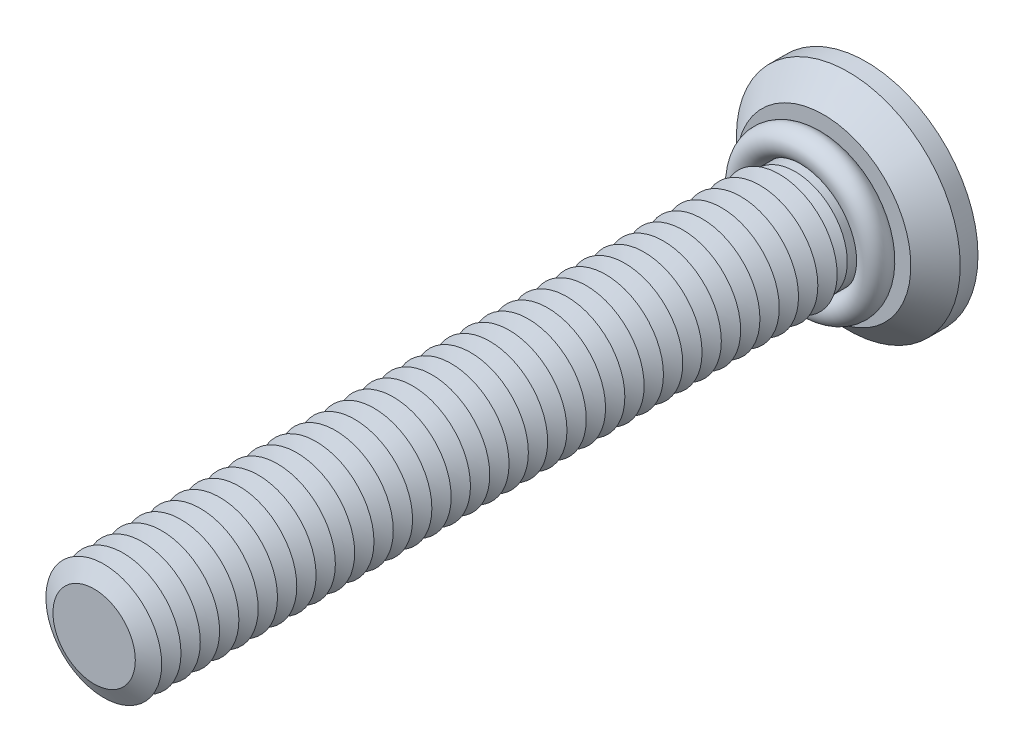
ISO-10303-21;
HEADER;
FILE_DESCRIPTION(('STEP AP214'),'2;1');
FILE_NAME('part.step','',(''),(''),'','','');
FILE_SCHEMA(('AUTOMOTIVE_DESIGN { 1 0 10303 214 1 1 1 1 }'));
ENDSEC;
DATA;
#1=APPLICATION_CONTEXT('core data for automotive mechanical design processes');
#2=APPLICATION_PROTOCOL_DEFINITION('international standard','automotive_design',2000,#1);
#3=PRODUCT_CONTEXT('',#1,'mechanical');
#4=PRODUCT('Part','Part','',(#3));
#5=PRODUCT_RELATED_PRODUCT_CATEGORY('part','',(#4));
#6=PRODUCT_DEFINITION_FORMATION('','',#4);
#7=PRODUCT_DEFINITION_CONTEXT('part definition',#1,'design');
#8=PRODUCT_DEFINITION('design','',#6,#7);
#9=PRODUCT_DEFINITION_SHAPE('','',#8);
#10=(LENGTH_UNIT() NAMED_UNIT(*) SI_UNIT(.MILLI.,.METRE.));
#11=(NAMED_UNIT(*) PLANE_ANGLE_UNIT() SI_UNIT($,.RADIAN.));
#12=(NAMED_UNIT(*) SI_UNIT($,.STERADIAN.) SOLID_ANGLE_UNIT());
#13=UNCERTAINTY_MEASURE_WITH_UNIT(LENGTH_MEASURE(1.E-05),#10,'distance_accuracy_value','');
#14=(GEOMETRIC_REPRESENTATION_CONTEXT(3) GLOBAL_UNCERTAINTY_ASSIGNED_CONTEXT((#13)) GLOBAL_UNIT_ASSIGNED_CONTEXT((#10,
#11,#12)) REPRESENTATION_CONTEXT('',''));
#15=CARTESIAN_POINT('',(0.,0.,0.));
#16=DIRECTION('',(0.,0.,1.));
#17=DIRECTION('',(1.,0.,0.));
#18=AXIS2_PLACEMENT_3D('',#15,#16,#17);
#19=CARTESIAN_POINT('',(0.,0.,1.45000000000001));
#20=DIRECTION('',(0.,0.,1.));
#21=DIRECTION('',(1.,0.,0.));
#22=AXIS2_PLACEMENT_3D('',#19,#20,#21);
#23=TOROIDAL_SURFACE('',#22,1.7,0.35);
#24=CARTESIAN_POINT('',(0.,1.7,1.45000000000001));
#25=DIRECTION('',(1.,0.,0.));
#26=DIRECTION('',(0.,0.,-1.));
#27=AXIS2_PLACEMENT_3D('',#24,#25,#26);
#28=CIRCLE('',#27,0.35);
#29=CARTESIAN_POINT('',(0.,2.05,1.45000000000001));
#30=VERTEX_POINT('',#29);
#31=EDGE_CURVE('P0_E10',#30,#30,#28,.T.);
#32=CARTESIAN_POINT('',(0.,0.,1.45000000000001));
#33=DIRECTION('',(0.,0.,1.));
#34=DIRECTION('',(1.,0.,0.));
#35=AXIS2_PLACEMENT_3D('',#32,#33,#34);
#36=CIRCLE('',#35,2.05);
#37=EDGE_CURVE('',#30,#30,#36,.T.);
#38=ORIENTED_EDGE('',*,*,#31,.F.);
#39=ORIENTED_EDGE('',*,*,#31,.T.);
#40=ORIENTED_EDGE('',*,*,#37,.T.);
#41=ORIENTED_EDGE('',*,*,#37,.F.);
#42=EDGE_LOOP('',(#38,#40,#39,#41));
#43=FACE_BOUND('',#42,.T.);
#44=ADVANCED_FACE('P0_F14',(#43),#23,.T.);
#45=CLOSED_SHELL('',(#44));
#46=MANIFOLD_SOLID_BREP('P0_B1',#45);
#47=CARTESIAN_POINT('',(0.,0.,17.5));
#48=DIRECTION('',(0.,0.,-1.));
#49=DIRECTION('',(-1.,0.,0.));
#50=AXIS2_PLACEMENT_3D('',#47,#48,#49);
#51=CONICAL_SURFACE('',#50,1.06698729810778,1.0471975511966);
#52=CARTESIAN_POINT('',(0.,0.,17.25));
#53=DIRECTION('',(0.,0.,1.));
#54=DIRECTION('',(1.,0.,0.));
#55=AXIS2_PLACEMENT_3D('',#52,#53,#54);
#56=CIRCLE('',#55,1.5);
#57=CARTESIAN_POINT('',(1.5,0.,17.25));
#58=VERTEX_POINT('',#57);
#59=EDGE_CURVE('P1_E324',#58,#58,#56,.T.);
#60=ORIENTED_EDGE('',*,*,#59,.T.);
#61=EDGE_LOOP('',(#60));
#62=FACE_BOUND('',#61,.T.);
#63=CARTESIAN_POINT('',(0.,0.,17.5));
#64=DIRECTION('',(0.,0.,1.));
#65=DIRECTION('',(1.,0.,0.));
#66=AXIS2_PLACEMENT_3D('',#63,#64,#65);
#67=CIRCLE('',#66,1.06698729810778);
#68=CARTESIAN_POINT('',(1.06698729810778,0.,17.5));
#69=VERTEX_POINT('',#68);
#70=EDGE_CURVE('P1_E321',#69,#69,#67,.T.);
#71=ORIENTED_EDGE('',*,*,#70,.F.);
#72=EDGE_LOOP('',(#71));
#73=FACE_BOUND('',#72,.T.);
#74=ADVANCED_FACE('P1_F15',(#62,#73),#51,.T.);
#75=CARTESIAN_POINT('',(0.,0.,17.75));
#76=DIRECTION('',(0.,0.,1.));
#77=DIRECTION('',(1.,0.,0.));
#78=AXIS2_PLACEMENT_3D('',#75,#76,#77);
#79=CONICAL_SURFACE('',#78,1.5,1.0471975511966);
#80=ORIENTED_EDGE('',*,*,#70,.T.);
#81=EDGE_LOOP('',(#80));
#82=FACE_BOUND('',#81,.T.);
#83=CARTESIAN_POINT('',(0.,0.,17.75));
#84=DIRECTION('',(0.,0.,1.));
#85=DIRECTION('',(1.,0.,0.));
#86=AXIS2_PLACEMENT_3D('',#83,#84,#85);
#87=CIRCLE('',#86,1.5);
#88=CARTESIAN_POINT('',(1.5,0.,17.75));
#89=VERTEX_POINT('',#88);
#90=EDGE_CURVE('P1_E318',#89,#89,#87,.T.);
#91=ORIENTED_EDGE('',*,*,#90,.F.);
#92=EDGE_LOOP('',(#91));
#93=FACE_BOUND('',#92,.T.);
#94=ADVANCED_FACE('P1_F245',(#82,#93),#79,.T.);
#95=CARTESIAN_POINT('',(0.,0.,20.));
#96=DIRECTION('',(0.,0.,1.));
#97=DIRECTION('',(1.,0.,0.));
#98=AXIS2_PLACEMENT_3D('',#95,#96,#97);
#99=PLANE('',#98);
#100=CARTESIAN_POINT('',(0.,0.,20.));
#101=DIRECTION('',(0.,0.,1.));
#102=DIRECTION('',(1.,0.,0.));
#103=AXIS2_PLACEMENT_3D('',#100,#101,#102);
#104=CIRCLE('',#103,1.06698729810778);
#105=CARTESIAN_POINT('',(1.06698729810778,0.,20.));
#106=VERTEX_POINT('',#105);
#107=EDGE_CURVE('P1_E131',#106,#106,#104,.T.);
#108=ORIENTED_EDGE('',*,*,#107,.T.);
#109=EDGE_LOOP('',(#108));
#110=FACE_BOUND('',#109,.T.);
#111=ADVANCED_FACE('P1_F251',(#110),#99,.T.);
#112=CARTESIAN_POINT('',(0.,0.,20.));
#113=DIRECTION('',(0.,0.,-1.));
#114=DIRECTION('',(-1.,0.,0.));
#115=AXIS2_PLACEMENT_3D('',#112,#113,#114);
#116=CONICAL_SURFACE('',#115,1.06698729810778,1.0471975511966);
#117=CARTESIAN_POINT('',(0.,0.,19.75));
#118=DIRECTION('',(0.,0.,1.));
#119=DIRECTION('',(1.,0.,0.));
#120=AXIS2_PLACEMENT_3D('',#117,#118,#119);
#121=CIRCLE('',#120,1.5);
#122=CARTESIAN_POINT('',(1.5,0.,19.75));
#123=VERTEX_POINT('',#122);
#124=EDGE_CURVE('P1_E133',#123,#123,#121,.T.);
#125=ORIENTED_EDGE('',*,*,#124,.T.);
#126=EDGE_LOOP('',(#125));
#127=FACE_BOUND('',#126,.T.);
#128=ORIENTED_EDGE('',*,*,#107,.F.);
#129=EDGE_LOOP('',(#128));
#130=FACE_BOUND('',#129,.T.);
#131=ADVANCED_FACE('P1_F196',(#127,#130),#116,.T.);
#132=CARTESIAN_POINT('',(0.,0.,19.75));
#133=DIRECTION('',(0.,0.,1.));
#134=DIRECTION('',(1.,0.,0.));
#135=AXIS2_PLACEMENT_3D('',#132,#133,#134);
#136=CONICAL_SURFACE('',#135,1.5,1.0471975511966);
#137=CARTESIAN_POINT('',(0.,0.,19.5));
#138=DIRECTION('',(0.,0.,1.));
#139=DIRECTION('',(1.,0.,0.));
#140=AXIS2_PLACEMENT_3D('',#137,#138,#139);
#141=CIRCLE('',#140,1.06698729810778);
#142=CARTESIAN_POINT('',(1.06698729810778,0.,19.5));
#143=VERTEX_POINT('',#142);
#144=EDGE_CURVE('P1_E297',#143,#143,#141,.T.);
#145=ORIENTED_EDGE('',*,*,#144,.T.);
#146=EDGE_LOOP('',(#145));
#147=FACE_BOUND('',#146,.T.);
#148=ORIENTED_EDGE('',*,*,#124,.F.);
#149=EDGE_LOOP('',(#148));
#150=FACE_BOUND('',#149,.T.);
#151=ADVANCED_FACE('P1_F284',(#147,#150),#136,.T.);
#152=CARTESIAN_POINT('',(0.,0.,19.5));
#153=DIRECTION('',(0.,0.,-1.));
#154=DIRECTION('',(-1.,0.,0.));
#155=AXIS2_PLACEMENT_3D('',#152,#153,#154);
#156=CONICAL_SURFACE('',#155,1.06698729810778,1.0471975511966);
#157=CARTESIAN_POINT('',(0.,0.,19.25));
#158=DIRECTION('',(0.,0.,1.));
#159=DIRECTION('',(1.,0.,0.));
#160=AXIS2_PLACEMENT_3D('',#157,#158,#159);
#161=CIRCLE('',#160,1.5);
#162=CARTESIAN_POINT('',(1.5,0.,19.25));
#163=VERTEX_POINT('',#162);
#164=EDGE_CURVE('P1_E294',#163,#163,#161,.T.);
#165=ORIENTED_EDGE('',*,*,#164,.T.);
#166=EDGE_LOOP('',(#165));
#167=FACE_BOUND('',#166,.T.);
#168=ORIENTED_EDGE('',*,*,#144,.F.);
#169=EDGE_LOOP('',(#168));
#170=FACE_BOUND('',#169,.T.);
#171=ADVANCED_FACE('P1_F279',(#167,#170),#156,.T.);
#172=CARTESIAN_POINT('',(0.,0.,19.25));
#173=DIRECTION('',(0.,0.,1.));
#174=DIRECTION('',(1.,0.,0.));
#175=AXIS2_PLACEMENT_3D('',#172,#173,#174);
#176=CONICAL_SURFACE('',#175,1.5,1.0471975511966);
#177=CARTESIAN_POINT('',(0.,0.,19.));
#178=DIRECTION('',(0.,0.,1.));
#179=DIRECTION('',(1.,0.,0.));
#180=AXIS2_PLACEMENT_3D('',#177,#178,#179);
#181=CIRCLE('',#180,1.06698729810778);
#182=CARTESIAN_POINT('',(1.06698729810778,0.,19.));
#183=VERTEX_POINT('',#182);
#184=EDGE_CURVE('P1_E301',#183,#183,#181,.T.);
#185=ORIENTED_EDGE('',*,*,#184,.T.);
#186=EDGE_LOOP('',(#185));
#187=FACE_BOUND('',#186,.T.);
#188=ORIENTED_EDGE('',*,*,#164,.F.);
#189=EDGE_LOOP('',(#188));
#190=FACE_BOUND('',#189,.T.);
#191=ADVANCED_FACE('P1_F276',(#187,#190),#176,.T.);
#192=CARTESIAN_POINT('',(0.,0.,19.));
#193=DIRECTION('',(0.,0.,-1.));
#194=DIRECTION('',(-1.,0.,0.));
#195=AXIS2_PLACEMENT_3D('',#192,#193,#194);
#196=CONICAL_SURFACE('',#195,1.06698729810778,1.0471975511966);
#197=CARTESIAN_POINT('',(0.,0.,18.75));
#198=DIRECTION('',(0.,0.,1.));
#199=DIRECTION('',(1.,0.,0.));
#200=AXIS2_PLACEMENT_3D('',#197,#198,#199);
#201=CIRCLE('',#200,1.5);
#202=CARTESIAN_POINT('',(1.5,0.,18.75));
#203=VERTEX_POINT('',#202);
#204=EDGE_CURVE('P1_E306',#203,#203,#201,.T.);
#205=ORIENTED_EDGE('',*,*,#204,.T.);
#206=EDGE_LOOP('',(#205));
#207=FACE_BOUND('',#206,.T.);
#208=ORIENTED_EDGE('',*,*,#184,.F.);
#209=EDGE_LOOP('',(#208));
#210=FACE_BOUND('',#209,.T.);
#211=ADVANCED_FACE('P1_F271',(#207,#210),#196,.T.);
#212=CARTESIAN_POINT('',(0.,0.,18.75));
#213=DIRECTION('',(0.,0.,1.));
#214=DIRECTION('',(1.,0.,0.));
#215=AXIS2_PLACEMENT_3D('',#212,#213,#214);
#216=CONICAL_SURFACE('',#215,1.5,1.0471975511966);
#217=CARTESIAN_POINT('',(0.,0.,18.5));
#218=DIRECTION('',(0.,0.,1.));
#219=DIRECTION('',(1.,0.,0.));
#220=AXIS2_PLACEMENT_3D('',#217,#218,#219);
#221=CIRCLE('',#220,1.06698729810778);
#222=CARTESIAN_POINT('',(1.06698729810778,0.,18.5));
#223=VERTEX_POINT('',#222);
#224=EDGE_CURVE('P1_E309',#223,#223,#221,.T.);
#225=ORIENTED_EDGE('',*,*,#224,.T.);
#226=EDGE_LOOP('',(#225));
#227=FACE_BOUND('',#226,.T.);
#228=ORIENTED_EDGE('',*,*,#204,.F.);
#229=EDGE_LOOP('',(#228));
#230=FACE_BOUND('',#229,.T.);
#231=ADVANCED_FACE('P1_F268',(#227,#230),#216,.T.);
#232=CARTESIAN_POINT('',(0.,0.,18.5));
#233=DIRECTION('',(0.,0.,-1.));
#234=DIRECTION('',(-1.,0.,0.));
#235=AXIS2_PLACEMENT_3D('',#232,#233,#234);
#236=CONICAL_SURFACE('',#235,1.06698729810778,1.0471975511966);
#237=CARTESIAN_POINT('',(0.,0.,18.25));
#238=DIRECTION('',(0.,0.,1.));
#239=DIRECTION('',(1.,0.,0.));
#240=AXIS2_PLACEMENT_3D('',#237,#238,#239);
#241=CIRCLE('',#240,1.5);
#242=CARTESIAN_POINT('',(1.5,0.,18.25));
#243=VERTEX_POINT('',#242);
#244=EDGE_CURVE('P1_E312',#243,#243,#241,.T.);
#245=ORIENTED_EDGE('',*,*,#244,.T.);
#246=EDGE_LOOP('',(#245));
#247=FACE_BOUND('',#246,.T.);
#248=ORIENTED_EDGE('',*,*,#224,.F.);
#249=EDGE_LOOP('',(#248));
#250=FACE_BOUND('',#249,.T.);
#251=ADVANCED_FACE('P1_F262',(#247,#250),#236,.T.);
#252=CARTESIAN_POINT('',(0.,0.,18.25));
#253=DIRECTION('',(0.,0.,1.));
#254=DIRECTION('',(1.,0.,0.));
#255=AXIS2_PLACEMENT_3D('',#252,#253,#254);
#256=CONICAL_SURFACE('',#255,1.5,1.0471975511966);
#257=CARTESIAN_POINT('',(0.,0.,18.));
#258=DIRECTION('',(0.,0.,1.));
#259=DIRECTION('',(1.,0.,0.));
#260=AXIS2_PLACEMENT_3D('',#257,#258,#259);
#261=CIRCLE('',#260,1.06698729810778);
#262=CARTESIAN_POINT('',(1.06698729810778,0.,18.));
#263=VERTEX_POINT('',#262);
#264=EDGE_CURVE('P1_E315',#263,#263,#261,.T.);
#265=ORIENTED_EDGE('',*,*,#264,.T.);
#266=EDGE_LOOP('',(#265));
#267=FACE_BOUND('',#266,.T.);
#268=ORIENTED_EDGE('',*,*,#244,.F.);
#269=EDGE_LOOP('',(#268));
#270=FACE_BOUND('',#269,.T.);
#271=ADVANCED_FACE('P1_F258',(#267,#270),#256,.T.);
#272=CARTESIAN_POINT('',(0.,0.,18.));
#273=DIRECTION('',(0.,0.,-1.));
#274=DIRECTION('',(-1.,0.,0.));
#275=AXIS2_PLACEMENT_3D('',#272,#273,#274);
#276=CONICAL_SURFACE('',#275,1.06698729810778,1.0471975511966);
#277=ORIENTED_EDGE('',*,*,#90,.T.);
#278=EDGE_LOOP('',(#277));
#279=FACE_BOUND('',#278,.T.);
#280=ORIENTED_EDGE('',*,*,#264,.F.);
#281=EDGE_LOOP('',(#280));
#282=FACE_BOUND('',#281,.T.);
#283=ADVANCED_FACE('P1_F261',(#279,#282),#276,.T.);
#284=CARTESIAN_POINT('',(0.,0.,17.));
#285=DIRECTION('',(0.,0.,-1.));
#286=DIRECTION('',(-1.,0.,0.));
#287=AXIS2_PLACEMENT_3D('',#284,#285,#286);
#288=CONICAL_SURFACE('',#287,1.06698729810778,1.0471975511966);
#289=CARTESIAN_POINT('',(0.,0.,16.75));
#290=DIRECTION('',(0.,0.,1.));
#291=DIRECTION('',(1.,0.,0.));
#292=AXIS2_PLACEMENT_3D('',#289,#290,#291);
#293=CIRCLE('',#292,1.5);
#294=CARTESIAN_POINT('',(1.5,0.,16.75));
#295=VERTEX_POINT('',#294);
#296=EDGE_CURVE('P1_E329',#295,#295,#293,.T.);
#297=ORIENTED_EDGE('',*,*,#296,.T.);
#298=EDGE_LOOP('',(#297));
#299=FACE_BOUND('',#298,.T.);
#300=CARTESIAN_POINT('',(0.,0.,17.));
#301=DIRECTION('',(0.,0.,1.));
#302=DIRECTION('',(1.,0.,0.));
#303=AXIS2_PLACEMENT_3D('',#300,#301,#302);
#304=CIRCLE('',#303,1.06698729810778);
#305=CARTESIAN_POINT('',(1.06698729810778,0.,17.));
#306=VERTEX_POINT('',#305);
#307=EDGE_CURVE('P1_E326',#306,#306,#304,.T.);
#308=ORIENTED_EDGE('',*,*,#307,.F.);
#309=EDGE_LOOP('',(#308));
#310=FACE_BOUND('',#309,.T.);
#311=ADVANCED_FACE('P1_F266',(#299,#310),#288,.T.);
#312=CARTESIAN_POINT('',(0.,0.,17.25));
#313=DIRECTION('',(0.,0.,1.));
#314=DIRECTION('',(1.,0.,0.));
#315=AXIS2_PLACEMENT_3D('',#312,#313,#314);
#316=CONICAL_SURFACE('',#315,1.5,1.0471975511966);
#317=ORIENTED_EDGE('',*,*,#307,.T.);
#318=EDGE_LOOP('',(#317));
#319=FACE_BOUND('',#318,.T.);
#320=ORIENTED_EDGE('',*,*,#59,.F.);
#321=EDGE_LOOP('',(#320));
#322=FACE_BOUND('',#321,.T.);
#323=ADVANCED_FACE('P1_F611',(#319,#322),#316,.T.);
#324=CARTESIAN_POINT('',(0.,0.,16.5));
#325=DIRECTION('',(0.,0.,-1.));
#326=DIRECTION('',(-1.,0.,0.));
#327=AXIS2_PLACEMENT_3D('',#324,#325,#326);
#328=CONICAL_SURFACE('',#327,1.06698729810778,1.0471975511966);
#329=CARTESIAN_POINT('',(0.,0.,16.25));
#330=DIRECTION('',(0.,0.,1.));
#331=DIRECTION('',(1.,0.,0.));
#332=AXIS2_PLACEMENT_3D('',#329,#330,#331);
#333=CIRCLE('',#332,1.5);
#334=CARTESIAN_POINT('',(1.5,0.,16.25));
#335=VERTEX_POINT('',#334);
#336=EDGE_CURVE('P1_E335',#335,#335,#333,.T.);
#337=ORIENTED_EDGE('',*,*,#336,.T.);
#338=EDGE_LOOP('',(#337));
#339=FACE_BOUND('',#338,.T.);
#340=CARTESIAN_POINT('',(0.,0.,16.5));
#341=DIRECTION('',(0.,0.,1.));
#342=DIRECTION('',(1.,0.,0.));
#343=AXIS2_PLACEMENT_3D('',#340,#341,#342);
#344=CIRCLE('',#343,1.06698729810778);
#345=CARTESIAN_POINT('',(1.06698729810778,0.,16.5));
#346=VERTEX_POINT('',#345);
#347=EDGE_CURVE('P1_E332',#346,#346,#344,.T.);
#348=ORIENTED_EDGE('',*,*,#347,.F.);
#349=EDGE_LOOP('',(#348));
#350=FACE_BOUND('',#349,.T.);
#351=ADVANCED_FACE('P1_F620',(#339,#350),#328,.T.);
#352=CARTESIAN_POINT('',(0.,0.,16.75));
#353=DIRECTION('',(0.,0.,1.));
#354=DIRECTION('',(1.,0.,0.));
#355=AXIS2_PLACEMENT_3D('',#352,#353,#354);
#356=CONICAL_SURFACE('',#355,1.5,1.0471975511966);
#357=ORIENTED_EDGE('',*,*,#347,.T.);
#358=EDGE_LOOP('',(#357));
#359=FACE_BOUND('',#358,.T.);
#360=ORIENTED_EDGE('',*,*,#296,.F.);
#361=EDGE_LOOP('',(#360));
#362=FACE_BOUND('',#361,.T.);
#363=ADVANCED_FACE('P1_F630',(#359,#362),#356,.T.);
#364=CARTESIAN_POINT('',(0.,0.,16.));
#365=DIRECTION('',(0.,0.,-1.));
#366=DIRECTION('',(-1.,0.,0.));
#367=AXIS2_PLACEMENT_3D('',#364,#365,#366);
#368=CONICAL_SURFACE('',#367,1.06698729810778,1.0471975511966);
#369=CARTESIAN_POINT('',(0.,0.,15.75));
#370=DIRECTION('',(0.,0.,1.));
#371=DIRECTION('',(1.,0.,0.));
#372=AXIS2_PLACEMENT_3D('',#369,#370,#371);
#373=CIRCLE('',#372,1.5);
#374=CARTESIAN_POINT('',(1.5,0.,15.75));
#375=VERTEX_POINT('',#374);
#376=EDGE_CURVE('P1_E341',#375,#375,#373,.T.);
#377=ORIENTED_EDGE('',*,*,#376,.T.);
#378=EDGE_LOOP('',(#377));
#379=FACE_BOUND('',#378,.T.);
#380=CARTESIAN_POINT('',(0.,0.,16.));
#381=DIRECTION('',(0.,0.,1.));
#382=DIRECTION('',(1.,0.,0.));
#383=AXIS2_PLACEMENT_3D('',#380,#381,#382);
#384=CIRCLE('',#383,1.06698729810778);
#385=CARTESIAN_POINT('',(1.06698729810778,0.,16.));
#386=VERTEX_POINT('',#385);
#387=EDGE_CURVE('P1_E338',#386,#386,#384,.T.);
#388=ORIENTED_EDGE('',*,*,#387,.F.);
#389=EDGE_LOOP('',(#388));
#390=FACE_BOUND('',#389,.T.);
#391=ADVANCED_FACE('P1_F640',(#379,#390),#368,.T.);
#392=CARTESIAN_POINT('',(0.,0.,16.25));
#393=DIRECTION('',(0.,0.,1.));
#394=DIRECTION('',(1.,0.,0.));
#395=AXIS2_PLACEMENT_3D('',#392,#393,#394);
#396=CONICAL_SURFACE('',#395,1.5,1.0471975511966);
#397=ORIENTED_EDGE('',*,*,#387,.T.);
#398=EDGE_LOOP('',(#397));
#399=FACE_BOUND('',#398,.T.);
#400=ORIENTED_EDGE('',*,*,#336,.F.);
#401=EDGE_LOOP('',(#400));
#402=FACE_BOUND('',#401,.T.);
#403=ADVANCED_FACE('P1_F650',(#399,#402),#396,.T.);
#404=CARTESIAN_POINT('',(0.,0.,15.5));
#405=DIRECTION('',(0.,0.,-1.));
#406=DIRECTION('',(-1.,0.,0.));
#407=AXIS2_PLACEMENT_3D('',#404,#405,#406);
#408=CONICAL_SURFACE('',#407,1.06698729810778,1.0471975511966);
#409=CARTESIAN_POINT('',(0.,0.,15.25));
#410=DIRECTION('',(0.,0.,1.));
#411=DIRECTION('',(1.,0.,0.));
#412=AXIS2_PLACEMENT_3D('',#409,#410,#411);
#413=CIRCLE('',#412,1.5);
#414=CARTESIAN_POINT('',(1.5,0.,15.25));
#415=VERTEX_POINT('',#414);
#416=EDGE_CURVE('P1_E347',#415,#415,#413,.T.);
#417=ORIENTED_EDGE('',*,*,#416,.T.);
#418=EDGE_LOOP('',(#417));
#419=FACE_BOUND('',#418,.T.);
#420=CARTESIAN_POINT('',(0.,0.,15.5));
#421=DIRECTION('',(0.,0.,1.));
#422=DIRECTION('',(1.,0.,0.));
#423=AXIS2_PLACEMENT_3D('',#420,#421,#422);
#424=CIRCLE('',#423,1.06698729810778);
#425=CARTESIAN_POINT('',(1.06698729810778,0.,15.5));
#426=VERTEX_POINT('',#425);
#427=EDGE_CURVE('P1_E344',#426,#426,#424,.T.);
#428=ORIENTED_EDGE('',*,*,#427,.F.);
#429=EDGE_LOOP('',(#428));
#430=FACE_BOUND('',#429,.T.);
#431=ADVANCED_FACE('P1_F660',(#419,#430),#408,.T.);
#432=CARTESIAN_POINT('',(0.,0.,15.75));
#433=DIRECTION('',(0.,0.,1.));
#434=DIRECTION('',(1.,0.,0.));
#435=AXIS2_PLACEMENT_3D('',#432,#433,#434);
#436=CONICAL_SURFACE('',#435,1.5,1.0471975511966);
#437=ORIENTED_EDGE('',*,*,#427,.T.);
#438=EDGE_LOOP('',(#437));
#439=FACE_BOUND('',#438,.T.);
#440=ORIENTED_EDGE('',*,*,#376,.F.);
#441=EDGE_LOOP('',(#440));
#442=FACE_BOUND('',#441,.T.);
#443=ADVANCED_FACE('P1_F670',(#439,#442),#436,.T.);
#444=CARTESIAN_POINT('',(0.,0.,15.));
#445=DIRECTION('',(0.,0.,-1.));
#446=DIRECTION('',(-1.,0.,0.));
#447=AXIS2_PLACEMENT_3D('',#444,#445,#446);
#448=CONICAL_SURFACE('',#447,1.06698729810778,1.0471975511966);
#449=CARTESIAN_POINT('',(0.,0.,14.75));
#450=DIRECTION('',(0.,0.,1.));
#451=DIRECTION('',(1.,0.,0.));
#452=AXIS2_PLACEMENT_3D('',#449,#450,#451);
#453=CIRCLE('',#452,1.5);
#454=CARTESIAN_POINT('',(1.5,0.,14.75));
#455=VERTEX_POINT('',#454);
#456=EDGE_CURVE('P1_E353',#455,#455,#453,.T.);
#457=ORIENTED_EDGE('',*,*,#456,.T.);
#458=EDGE_LOOP('',(#457));
#459=FACE_BOUND('',#458,.T.);
#460=CARTESIAN_POINT('',(0.,0.,15.));
#461=DIRECTION('',(0.,0.,1.));
#462=DIRECTION('',(1.,0.,0.));
#463=AXIS2_PLACEMENT_3D('',#460,#461,#462);
#464=CIRCLE('',#463,1.06698729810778);
#465=CARTESIAN_POINT('',(1.06698729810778,0.,15.));
#466=VERTEX_POINT('',#465);
#467=EDGE_CURVE('P1_E350',#466,#466,#464,.T.);
#468=ORIENTED_EDGE('',*,*,#467,.F.);
#469=EDGE_LOOP('',(#468));
#470=FACE_BOUND('',#469,.T.);
#471=ADVANCED_FACE('P1_F680',(#459,#470),#448,.T.);
#472=CARTESIAN_POINT('',(0.,0.,15.25));
#473=DIRECTION('',(0.,0.,1.));
#474=DIRECTION('',(1.,0.,0.));
#475=AXIS2_PLACEMENT_3D('',#472,#473,#474);
#476=CONICAL_SURFACE('',#475,1.5,1.0471975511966);
#477=ORIENTED_EDGE('',*,*,#467,.T.);
#478=EDGE_LOOP('',(#477));
#479=FACE_BOUND('',#478,.T.);
#480=ORIENTED_EDGE('',*,*,#416,.F.);
#481=EDGE_LOOP('',(#480));
#482=FACE_BOUND('',#481,.T.);
#483=ADVANCED_FACE('P1_F690',(#479,#482),#476,.T.);
#484=CARTESIAN_POINT('',(0.,0.,14.5));
#485=DIRECTION('',(0.,0.,-1.));
#486=DIRECTION('',(-1.,0.,0.));
#487=AXIS2_PLACEMENT_3D('',#484,#485,#486);
#488=CONICAL_SURFACE('',#487,1.06698729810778,1.0471975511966);
#489=CARTESIAN_POINT('',(0.,0.,14.25));
#490=DIRECTION('',(0.,0.,1.));
#491=DIRECTION('',(1.,0.,0.));
#492=AXIS2_PLACEMENT_3D('',#489,#490,#491);
#493=CIRCLE('',#492,1.5);
#494=CARTESIAN_POINT('',(1.5,0.,14.25));
#495=VERTEX_POINT('',#494);
#496=EDGE_CURVE('P1_E359',#495,#495,#493,.T.);
#497=ORIENTED_EDGE('',*,*,#496,.T.);
#498=EDGE_LOOP('',(#497));
#499=FACE_BOUND('',#498,.T.);
#500=CARTESIAN_POINT('',(0.,0.,14.5));
#501=DIRECTION('',(0.,0.,1.));
#502=DIRECTION('',(1.,0.,0.));
#503=AXIS2_PLACEMENT_3D('',#500,#501,#502);
#504=CIRCLE('',#503,1.06698729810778);
#505=CARTESIAN_POINT('',(1.06698729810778,0.,14.5));
#506=VERTEX_POINT('',#505);
#507=EDGE_CURVE('P1_E356',#506,#506,#504,.T.);
#508=ORIENTED_EDGE('',*,*,#507,.F.);
#509=EDGE_LOOP('',(#508));
#510=FACE_BOUND('',#509,.T.);
#511=ADVANCED_FACE('P1_F700',(#499,#510),#488,.T.);
#512=CARTESIAN_POINT('',(0.,0.,14.75));
#513=DIRECTION('',(0.,0.,1.));
#514=DIRECTION('',(1.,0.,0.));
#515=AXIS2_PLACEMENT_3D('',#512,#513,#514);
#516=CONICAL_SURFACE('',#515,1.5,1.0471975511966);
#517=ORIENTED_EDGE('',*,*,#507,.T.);
#518=EDGE_LOOP('',(#517));
#519=FACE_BOUND('',#518,.T.);
#520=ORIENTED_EDGE('',*,*,#456,.F.);
#521=EDGE_LOOP('',(#520));
#522=FACE_BOUND('',#521,.T.);
#523=ADVANCED_FACE('P1_F710',(#519,#522),#516,.T.);
#524=CARTESIAN_POINT('',(0.,0.,14.));
#525=DIRECTION('',(0.,0.,-1.));
#526=DIRECTION('',(-1.,0.,0.));
#527=AXIS2_PLACEMENT_3D('',#524,#525,#526);
#528=CONICAL_SURFACE('',#527,1.06698729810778,1.0471975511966);
#529=CARTESIAN_POINT('',(0.,0.,13.75));
#530=DIRECTION('',(0.,0.,1.));
#531=DIRECTION('',(1.,0.,0.));
#532=AXIS2_PLACEMENT_3D('',#529,#530,#531);
#533=CIRCLE('',#532,1.5);
#534=CARTESIAN_POINT('',(1.5,0.,13.75));
#535=VERTEX_POINT('',#534);
#536=EDGE_CURVE('P1_E365',#535,#535,#533,.T.);
#537=ORIENTED_EDGE('',*,*,#536,.T.);
#538=EDGE_LOOP('',(#537));
#539=FACE_BOUND('',#538,.T.);
#540=CARTESIAN_POINT('',(0.,0.,14.));
#541=DIRECTION('',(0.,0.,1.));
#542=DIRECTION('',(1.,0.,0.));
#543=AXIS2_PLACEMENT_3D('',#540,#541,#542);
#544=CIRCLE('',#543,1.06698729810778);
#545=CARTESIAN_POINT('',(1.06698729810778,0.,14.));
#546=VERTEX_POINT('',#545);
#547=EDGE_CURVE('P1_E362',#546,#546,#544,.T.);
#548=ORIENTED_EDGE('',*,*,#547,.F.);
#549=EDGE_LOOP('',(#548));
#550=FACE_BOUND('',#549,.T.);
#551=ADVANCED_FACE('P1_F720',(#539,#550),#528,.T.);
#552=CARTESIAN_POINT('',(0.,0.,14.25));
#553=DIRECTION('',(0.,0.,1.));
#554=DIRECTION('',(1.,0.,0.));
#555=AXIS2_PLACEMENT_3D('',#552,#553,#554);
#556=CONICAL_SURFACE('',#555,1.5,1.0471975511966);
#557=ORIENTED_EDGE('',*,*,#547,.T.);
#558=EDGE_LOOP('',(#557));
#559=FACE_BOUND('',#558,.T.);
#560=ORIENTED_EDGE('',*,*,#496,.F.);
#561=EDGE_LOOP('',(#560));
#562=FACE_BOUND('',#561,.T.);
#563=ADVANCED_FACE('P1_F730',(#559,#562),#556,.T.);
#564=CARTESIAN_POINT('',(0.,0.,13.5));
#565=DIRECTION('',(0.,0.,-1.));
#566=DIRECTION('',(-1.,0.,0.));
#567=AXIS2_PLACEMENT_3D('',#564,#565,#566);
#568=CONICAL_SURFACE('',#567,1.06698729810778,1.0471975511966);
#569=CARTESIAN_POINT('',(0.,0.,13.25));
#570=DIRECTION('',(0.,0.,1.));
#571=DIRECTION('',(1.,0.,0.));
#572=AXIS2_PLACEMENT_3D('',#569,#570,#571);
#573=CIRCLE('',#572,1.5);
#574=CARTESIAN_POINT('',(1.5,0.,13.25));
#575=VERTEX_POINT('',#574);
#576=EDGE_CURVE('P1_E371',#575,#575,#573,.T.);
#577=ORIENTED_EDGE('',*,*,#576,.T.);
#578=EDGE_LOOP('',(#577));
#579=FACE_BOUND('',#578,.T.);
#580=CARTESIAN_POINT('',(0.,0.,13.5));
#581=DIRECTION('',(0.,0.,1.));
#582=DIRECTION('',(1.,0.,0.));
#583=AXIS2_PLACEMENT_3D('',#580,#581,#582);
#584=CIRCLE('',#583,1.06698729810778);
#585=CARTESIAN_POINT('',(1.06698729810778,0.,13.5));
#586=VERTEX_POINT('',#585);
#587=EDGE_CURVE('P1_E368',#586,#586,#584,.T.);
#588=ORIENTED_EDGE('',*,*,#587,.F.);
#589=EDGE_LOOP('',(#588));
#590=FACE_BOUND('',#589,.T.);
#591=ADVANCED_FACE('P1_F740',(#579,#590),#568,.T.);
#592=CARTESIAN_POINT('',(0.,0.,13.75));
#593=DIRECTION('',(0.,0.,1.));
#594=DIRECTION('',(1.,0.,0.));
#595=AXIS2_PLACEMENT_3D('',#592,#593,#594);
#596=CONICAL_SURFACE('',#595,1.5,1.0471975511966);
#597=ORIENTED_EDGE('',*,*,#587,.T.);
#598=EDGE_LOOP('',(#597));
#599=FACE_BOUND('',#598,.T.);
#600=ORIENTED_EDGE('',*,*,#536,.F.);
#601=EDGE_LOOP('',(#600));
#602=FACE_BOUND('',#601,.T.);
#603=ADVANCED_FACE('P1_F750',(#599,#602),#596,.T.);
#604=CARTESIAN_POINT('',(0.,0.,13.));
#605=DIRECTION('',(0.,0.,-1.));
#606=DIRECTION('',(-1.,0.,0.));
#607=AXIS2_PLACEMENT_3D('',#604,#605,#606);
#608=CONICAL_SURFACE('',#607,1.06698729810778,1.0471975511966);
#609=CARTESIAN_POINT('',(0.,0.,12.75));
#610=DIRECTION('',(0.,0.,1.));
#611=DIRECTION('',(1.,0.,0.));
#612=AXIS2_PLACEMENT_3D('',#609,#610,#611);
#613=CIRCLE('',#612,1.5);
#614=CARTESIAN_POINT('',(1.5,0.,12.75));
#615=VERTEX_POINT('',#614);
#616=EDGE_CURVE('P1_E377',#615,#615,#613,.T.);
#617=ORIENTED_EDGE('',*,*,#616,.T.);
#618=EDGE_LOOP('',(#617));
#619=FACE_BOUND('',#618,.T.);
#620=CARTESIAN_POINT('',(0.,0.,13.));
#621=DIRECTION('',(0.,0.,1.));
#622=DIRECTION('',(1.,0.,0.));
#623=AXIS2_PLACEMENT_3D('',#620,#621,#622);
#624=CIRCLE('',#623,1.06698729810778);
#625=CARTESIAN_POINT('',(1.06698729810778,0.,13.));
#626=VERTEX_POINT('',#625);
#627=EDGE_CURVE('P1_E374',#626,#626,#624,.T.);
#628=ORIENTED_EDGE('',*,*,#627,.F.);
#629=EDGE_LOOP('',(#628));
#630=FACE_BOUND('',#629,.T.);
#631=ADVANCED_FACE('P1_F760',(#619,#630),#608,.T.);
#632=CARTESIAN_POINT('',(0.,0.,13.25));
#633=DIRECTION('',(0.,0.,1.));
#634=DIRECTION('',(1.,0.,0.));
#635=AXIS2_PLACEMENT_3D('',#632,#633,#634);
#636=CONICAL_SURFACE('',#635,1.5,1.0471975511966);
#637=ORIENTED_EDGE('',*,*,#627,.T.);
#638=EDGE_LOOP('',(#637));
#639=FACE_BOUND('',#638,.T.);
#640=ORIENTED_EDGE('',*,*,#576,.F.);
#641=EDGE_LOOP('',(#640));
#642=FACE_BOUND('',#641,.T.);
#643=ADVANCED_FACE('P1_F770',(#639,#642),#636,.T.);
#644=CARTESIAN_POINT('',(0.,0.,12.5));
#645=DIRECTION('',(0.,0.,-1.));
#646=DIRECTION('',(-1.,0.,0.));
#647=AXIS2_PLACEMENT_3D('',#644,#645,#646);
#648=CONICAL_SURFACE('',#647,1.06698729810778,1.0471975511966);
#649=CARTESIAN_POINT('',(0.,0.,12.25));
#650=DIRECTION('',(0.,0.,1.));
#651=DIRECTION('',(1.,0.,0.));
#652=AXIS2_PLACEMENT_3D('',#649,#650,#651);
#653=CIRCLE('',#652,1.5);
#654=CARTESIAN_POINT('',(1.5,0.,12.25));
#655=VERTEX_POINT('',#654);
#656=EDGE_CURVE('P1_E383',#655,#655,#653,.T.);
#657=ORIENTED_EDGE('',*,*,#656,.T.);
#658=EDGE_LOOP('',(#657));
#659=FACE_BOUND('',#658,.T.);
#660=CARTESIAN_POINT('',(0.,0.,12.5));
#661=DIRECTION('',(0.,0.,1.));
#662=DIRECTION('',(1.,0.,0.));
#663=AXIS2_PLACEMENT_3D('',#660,#661,#662);
#664=CIRCLE('',#663,1.06698729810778);
#665=CARTESIAN_POINT('',(1.06698729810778,0.,12.5));
#666=VERTEX_POINT('',#665);
#667=EDGE_CURVE('P1_E380',#666,#666,#664,.T.);
#668=ORIENTED_EDGE('',*,*,#667,.F.);
#669=EDGE_LOOP('',(#668));
#670=FACE_BOUND('',#669,.T.);
#671=ADVANCED_FACE('P1_F780',(#659,#670),#648,.T.);
#672=CARTESIAN_POINT('',(0.,0.,12.75));
#673=DIRECTION('',(0.,0.,1.));
#674=DIRECTION('',(1.,0.,0.));
#675=AXIS2_PLACEMENT_3D('',#672,#673,#674);
#676=CONICAL_SURFACE('',#675,1.5,1.0471975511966);
#677=ORIENTED_EDGE('',*,*,#667,.T.);
#678=EDGE_LOOP('',(#677));
#679=FACE_BOUND('',#678,.T.);
#680=ORIENTED_EDGE('',*,*,#616,.F.);
#681=EDGE_LOOP('',(#680));
#682=FACE_BOUND('',#681,.T.);
#683=ADVANCED_FACE('P1_F790',(#679,#682),#676,.T.);
#684=CARTESIAN_POINT('',(0.,0.,12.));
#685=DIRECTION('',(0.,0.,-1.));
#686=DIRECTION('',(-1.,0.,0.));
#687=AXIS2_PLACEMENT_3D('',#684,#685,#686);
#688=CONICAL_SURFACE('',#687,1.06698729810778,1.0471975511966);
#689=CARTESIAN_POINT('',(0.,0.,11.75));
#690=DIRECTION('',(0.,0.,1.));
#691=DIRECTION('',(1.,0.,0.));
#692=AXIS2_PLACEMENT_3D('',#689,#690,#691);
#693=CIRCLE('',#692,1.5);
#694=CARTESIAN_POINT('',(1.5,0.,11.75));
#695=VERTEX_POINT('',#694);
#696=EDGE_CURVE('P1_E389',#695,#695,#693,.T.);
#697=ORIENTED_EDGE('',*,*,#696,.T.);
#698=EDGE_LOOP('',(#697));
#699=FACE_BOUND('',#698,.T.);
#700=CARTESIAN_POINT('',(0.,0.,12.));
#701=DIRECTION('',(0.,0.,1.));
#702=DIRECTION('',(1.,0.,0.));
#703=AXIS2_PLACEMENT_3D('',#700,#701,#702);
#704=CIRCLE('',#703,1.06698729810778);
#705=CARTESIAN_POINT('',(1.06698729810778,0.,12.));
#706=VERTEX_POINT('',#705);
#707=EDGE_CURVE('P1_E386',#706,#706,#704,.T.);
#708=ORIENTED_EDGE('',*,*,#707,.F.);
#709=EDGE_LOOP('',(#708));
#710=FACE_BOUND('',#709,.T.);
#711=ADVANCED_FACE('P1_F800',(#699,#710),#688,.T.);
#712=CARTESIAN_POINT('',(0.,0.,12.25));
#713=DIRECTION('',(0.,0.,1.));
#714=DIRECTION('',(1.,0.,0.));
#715=AXIS2_PLACEMENT_3D('',#712,#713,#714);
#716=CONICAL_SURFACE('',#715,1.5,1.0471975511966);
#717=ORIENTED_EDGE('',*,*,#707,.T.);
#718=EDGE_LOOP('',(#717));
#719=FACE_BOUND('',#718,.T.);
#720=ORIENTED_EDGE('',*,*,#656,.F.);
#721=EDGE_LOOP('',(#720));
#722=FACE_BOUND('',#721,.T.);
#723=ADVANCED_FACE('P1_F810',(#719,#722),#716,.T.);
#724=CARTESIAN_POINT('',(0.,0.,11.5));
#725=DIRECTION('',(0.,0.,-1.));
#726=DIRECTION('',(-1.,0.,0.));
#727=AXIS2_PLACEMENT_3D('',#724,#725,#726);
#728=CONICAL_SURFACE('',#727,1.06698729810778,1.0471975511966);
#729=CARTESIAN_POINT('',(0.,0.,11.25));
#730=DIRECTION('',(0.,0.,1.));
#731=DIRECTION('',(1.,0.,0.));
#732=AXIS2_PLACEMENT_3D('',#729,#730,#731);
#733=CIRCLE('',#732,1.5);
#734=CARTESIAN_POINT('',(1.5,0.,11.25));
#735=VERTEX_POINT('',#734);
#736=EDGE_CURVE('P1_E395',#735,#735,#733,.T.);
#737=ORIENTED_EDGE('',*,*,#736,.T.);
#738=EDGE_LOOP('',(#737));
#739=FACE_BOUND('',#738,.T.);
#740=CARTESIAN_POINT('',(0.,0.,11.5));
#741=DIRECTION('',(0.,0.,1.));
#742=DIRECTION('',(1.,0.,0.));
#743=AXIS2_PLACEMENT_3D('',#740,#741,#742);
#744=CIRCLE('',#743,1.06698729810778);
#745=CARTESIAN_POINT('',(1.06698729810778,0.,11.5));
#746=VERTEX_POINT('',#745);
#747=EDGE_CURVE('P1_E392',#746,#746,#744,.T.);
#748=ORIENTED_EDGE('',*,*,#747,.F.);
#749=EDGE_LOOP('',(#748));
#750=FACE_BOUND('',#749,.T.);
#751=ADVANCED_FACE('P1_F820',(#739,#750),#728,.T.);
#752=CARTESIAN_POINT('',(0.,0.,11.75));
#753=DIRECTION('',(0.,0.,1.));
#754=DIRECTION('',(1.,0.,0.));
#755=AXIS2_PLACEMENT_3D('',#752,#753,#754);
#756=CONICAL_SURFACE('',#755,1.5,1.0471975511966);
#757=ORIENTED_EDGE('',*,*,#747,.T.);
#758=EDGE_LOOP('',(#757));
#759=FACE_BOUND('',#758,.T.);
#760=ORIENTED_EDGE('',*,*,#696,.F.);
#761=EDGE_LOOP('',(#760));
#762=FACE_BOUND('',#761,.T.);
#763=ADVANCED_FACE('P1_F830',(#759,#762),#756,.T.);
#764=CARTESIAN_POINT('',(0.,0.,11.));
#765=DIRECTION('',(0.,0.,-1.));
#766=DIRECTION('',(-1.,0.,0.));
#767=AXIS2_PLACEMENT_3D('',#764,#765,#766);
#768=CONICAL_SURFACE('',#767,1.06698729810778,1.0471975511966);
#769=CARTESIAN_POINT('',(0.,0.,10.75));
#770=DIRECTION('',(0.,0.,1.));
#771=DIRECTION('',(1.,0.,0.));
#772=AXIS2_PLACEMENT_3D('',#769,#770,#771);
#773=CIRCLE('',#772,1.5);
#774=CARTESIAN_POINT('',(1.5,0.,10.75));
#775=VERTEX_POINT('',#774);
#776=EDGE_CURVE('P1_E401',#775,#775,#773,.T.);
#777=ORIENTED_EDGE('',*,*,#776,.T.);
#778=EDGE_LOOP('',(#777));
#779=FACE_BOUND('',#778,.T.);
#780=CARTESIAN_POINT('',(0.,0.,11.));
#781=DIRECTION('',(0.,0.,1.));
#782=DIRECTION('',(1.,0.,0.));
#783=AXIS2_PLACEMENT_3D('',#780,#781,#782);
#784=CIRCLE('',#783,1.06698729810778);
#785=CARTESIAN_POINT('',(1.06698729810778,0.,11.));
#786=VERTEX_POINT('',#785);
#787=EDGE_CURVE('P1_E398',#786,#786,#784,.T.);
#788=ORIENTED_EDGE('',*,*,#787,.F.);
#789=EDGE_LOOP('',(#788));
#790=FACE_BOUND('',#789,.T.);
#791=ADVANCED_FACE('P1_F840',(#779,#790),#768,.T.);
#792=CARTESIAN_POINT('',(0.,0.,11.25));
#793=DIRECTION('',(0.,0.,1.));
#794=DIRECTION('',(1.,0.,0.));
#795=AXIS2_PLACEMENT_3D('',#792,#793,#794);
#796=CONICAL_SURFACE('',#795,1.5,1.0471975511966);
#797=ORIENTED_EDGE('',*,*,#787,.T.);
#798=EDGE_LOOP('',(#797));
#799=FACE_BOUND('',#798,.T.);
#800=ORIENTED_EDGE('',*,*,#736,.F.);
#801=EDGE_LOOP('',(#800));
#802=FACE_BOUND('',#801,.T.);
#803=ADVANCED_FACE('P1_F850',(#799,#802),#796,.T.);
#804=CARTESIAN_POINT('',(0.,0.,10.5));
#805=DIRECTION('',(0.,0.,-1.));
#806=DIRECTION('',(-1.,0.,0.));
#807=AXIS2_PLACEMENT_3D('',#804,#805,#806);
#808=CONICAL_SURFACE('',#807,1.06698729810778,1.0471975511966);
#809=CARTESIAN_POINT('',(0.,0.,10.25));
#810=DIRECTION('',(0.,0.,1.));
#811=DIRECTION('',(1.,0.,0.));
#812=AXIS2_PLACEMENT_3D('',#809,#810,#811);
#813=CIRCLE('',#812,1.5);
#814=CARTESIAN_POINT('',(1.5,0.,10.25));
#815=VERTEX_POINT('',#814);
#816=EDGE_CURVE('P1_E407',#815,#815,#813,.T.);
#817=ORIENTED_EDGE('',*,*,#816,.T.);
#818=EDGE_LOOP('',(#817));
#819=FACE_BOUND('',#818,.T.);
#820=CARTESIAN_POINT('',(0.,0.,10.5));
#821=DIRECTION('',(0.,0.,1.));
#822=DIRECTION('',(1.,0.,0.));
#823=AXIS2_PLACEMENT_3D('',#820,#821,#822);
#824=CIRCLE('',#823,1.06698729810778);
#825=CARTESIAN_POINT('',(1.06698729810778,0.,10.5));
#826=VERTEX_POINT('',#825);
#827=EDGE_CURVE('P1_E404',#826,#826,#824,.T.);
#828=ORIENTED_EDGE('',*,*,#827,.F.);
#829=EDGE_LOOP('',(#828));
#830=FACE_BOUND('',#829,.T.);
#831=ADVANCED_FACE('P1_F860',(#819,#830),#808,.T.);
#832=CARTESIAN_POINT('',(0.,0.,10.75));
#833=DIRECTION('',(0.,0.,1.));
#834=DIRECTION('',(1.,0.,0.));
#835=AXIS2_PLACEMENT_3D('',#832,#833,#834);
#836=CONICAL_SURFACE('',#835,1.5,1.0471975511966);
#837=ORIENTED_EDGE('',*,*,#827,.T.);
#838=EDGE_LOOP('',(#837));
#839=FACE_BOUND('',#838,.T.);
#840=ORIENTED_EDGE('',*,*,#776,.F.);
#841=EDGE_LOOP('',(#840));
#842=FACE_BOUND('',#841,.T.);
#843=ADVANCED_FACE('P1_F870',(#839,#842),#836,.T.);
#844=CARTESIAN_POINT('',(0.,0.,10.));
#845=DIRECTION('',(0.,0.,-1.));
#846=DIRECTION('',(-1.,0.,0.));
#847=AXIS2_PLACEMENT_3D('',#844,#845,#846);
#848=CONICAL_SURFACE('',#847,1.06698729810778,1.0471975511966);
#849=CARTESIAN_POINT('',(0.,0.,9.75));
#850=DIRECTION('',(0.,0.,1.));
#851=DIRECTION('',(1.,0.,0.));
#852=AXIS2_PLACEMENT_3D('',#849,#850,#851);
#853=CIRCLE('',#852,1.5);
#854=CARTESIAN_POINT('',(1.5,0.,9.75));
#855=VERTEX_POINT('',#854);
#856=EDGE_CURVE('P1_E413',#855,#855,#853,.T.);
#857=ORIENTED_EDGE('',*,*,#856,.T.);
#858=EDGE_LOOP('',(#857));
#859=FACE_BOUND('',#858,.T.);
#860=CARTESIAN_POINT('',(0.,0.,10.));
#861=DIRECTION('',(0.,0.,1.));
#862=DIRECTION('',(1.,0.,0.));
#863=AXIS2_PLACEMENT_3D('',#860,#861,#862);
#864=CIRCLE('',#863,1.06698729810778);
#865=CARTESIAN_POINT('',(1.06698729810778,0.,10.));
#866=VERTEX_POINT('',#865);
#867=EDGE_CURVE('P1_E410',#866,#866,#864,.T.);
#868=ORIENTED_EDGE('',*,*,#867,.F.);
#869=EDGE_LOOP('',(#868));
#870=FACE_BOUND('',#869,.T.);
#871=ADVANCED_FACE('P1_F880',(#859,#870),#848,.T.);
#872=CARTESIAN_POINT('',(0.,0.,10.25));
#873=DIRECTION('',(0.,0.,1.));
#874=DIRECTION('',(1.,0.,0.));
#875=AXIS2_PLACEMENT_3D('',#872,#873,#874);
#876=CONICAL_SURFACE('',#875,1.5,1.0471975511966);
#877=ORIENTED_EDGE('',*,*,#867,.T.);
#878=EDGE_LOOP('',(#877));
#879=FACE_BOUND('',#878,.T.);
#880=ORIENTED_EDGE('',*,*,#816,.F.);
#881=EDGE_LOOP('',(#880));
#882=FACE_BOUND('',#881,.T.);
#883=ADVANCED_FACE('P1_F890',(#879,#882),#876,.T.);
#884=CARTESIAN_POINT('',(0.,0.,9.5));
#885=DIRECTION('',(0.,0.,-1.));
#886=DIRECTION('',(-1.,0.,0.));
#887=AXIS2_PLACEMENT_3D('',#884,#885,#886);
#888=CONICAL_SURFACE('',#887,1.06698729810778,1.0471975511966);
#889=CARTESIAN_POINT('',(0.,0.,9.25));
#890=DIRECTION('',(0.,0.,1.));
#891=DIRECTION('',(1.,0.,0.));
#892=AXIS2_PLACEMENT_3D('',#889,#890,#891);
#893=CIRCLE('',#892,1.5);
#894=CARTESIAN_POINT('',(1.5,0.,9.25));
#895=VERTEX_POINT('',#894);
#896=EDGE_CURVE('P1_E419',#895,#895,#893,.T.);
#897=ORIENTED_EDGE('',*,*,#896,.T.);
#898=EDGE_LOOP('',(#897));
#899=FACE_BOUND('',#898,.T.);
#900=CARTESIAN_POINT('',(0.,0.,9.5));
#901=DIRECTION('',(0.,0.,1.));
#902=DIRECTION('',(1.,0.,0.));
#903=AXIS2_PLACEMENT_3D('',#900,#901,#902);
#904=CIRCLE('',#903,1.06698729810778);
#905=CARTESIAN_POINT('',(1.06698729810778,0.,9.5));
#906=VERTEX_POINT('',#905);
#907=EDGE_CURVE('P1_E416',#906,#906,#904,.T.);
#908=ORIENTED_EDGE('',*,*,#907,.F.);
#909=EDGE_LOOP('',(#908));
#910=FACE_BOUND('',#909,.T.);
#911=ADVANCED_FACE('P1_F900',(#899,#910),#888,.T.);
#912=CARTESIAN_POINT('',(0.,0.,9.75));
#913=DIRECTION('',(0.,0.,1.));
#914=DIRECTION('',(1.,0.,0.));
#915=AXIS2_PLACEMENT_3D('',#912,#913,#914);
#916=CONICAL_SURFACE('',#915,1.5,1.0471975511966);
#917=ORIENTED_EDGE('',*,*,#907,.T.);
#918=EDGE_LOOP('',(#917));
#919=FACE_BOUND('',#918,.T.);
#920=ORIENTED_EDGE('',*,*,#856,.F.);
#921=EDGE_LOOP('',(#920));
#922=FACE_BOUND('',#921,.T.);
#923=ADVANCED_FACE('P1_F910',(#919,#922),#916,.T.);
#924=CARTESIAN_POINT('',(0.,0.,9.));
#925=DIRECTION('',(0.,0.,-1.));
#926=DIRECTION('',(-1.,0.,0.));
#927=AXIS2_PLACEMENT_3D('',#924,#925,#926);
#928=CONICAL_SURFACE('',#927,1.06698729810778,1.0471975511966);
#929=CARTESIAN_POINT('',(0.,0.,8.75));
#930=DIRECTION('',(0.,0.,1.));
#931=DIRECTION('',(1.,0.,0.));
#932=AXIS2_PLACEMENT_3D('',#929,#930,#931);
#933=CIRCLE('',#932,1.5);
#934=CARTESIAN_POINT('',(1.5,0.,8.75));
#935=VERTEX_POINT('',#934);
#936=EDGE_CURVE('P1_E425',#935,#935,#933,.T.);
#937=ORIENTED_EDGE('',*,*,#936,.T.);
#938=EDGE_LOOP('',(#937));
#939=FACE_BOUND('',#938,.T.);
#940=CARTESIAN_POINT('',(0.,0.,9.));
#941=DIRECTION('',(0.,0.,1.));
#942=DIRECTION('',(1.,0.,0.));
#943=AXIS2_PLACEMENT_3D('',#940,#941,#942);
#944=CIRCLE('',#943,1.06698729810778);
#945=CARTESIAN_POINT('',(1.06698729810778,0.,9.));
#946=VERTEX_POINT('',#945);
#947=EDGE_CURVE('P1_E422',#946,#946,#944,.T.);
#948=ORIENTED_EDGE('',*,*,#947,.F.);
#949=EDGE_LOOP('',(#948));
#950=FACE_BOUND('',#949,.T.);
#951=ADVANCED_FACE('P1_F920',(#939,#950),#928,.T.);
#952=CARTESIAN_POINT('',(0.,0.,9.25));
#953=DIRECTION('',(0.,0.,1.));
#954=DIRECTION('',(1.,0.,0.));
#955=AXIS2_PLACEMENT_3D('',#952,#953,#954);
#956=CONICAL_SURFACE('',#955,1.5,1.0471975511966);
#957=ORIENTED_EDGE('',*,*,#947,.T.);
#958=EDGE_LOOP('',(#957));
#959=FACE_BOUND('',#958,.T.);
#960=ORIENTED_EDGE('',*,*,#896,.F.);
#961=EDGE_LOOP('',(#960));
#962=FACE_BOUND('',#961,.T.);
#963=ADVANCED_FACE('P1_F930',(#959,#962),#956,.T.);
#964=CARTESIAN_POINT('',(0.,0.,8.5));
#965=DIRECTION('',(0.,0.,-1.));
#966=DIRECTION('',(-1.,0.,0.));
#967=AXIS2_PLACEMENT_3D('',#964,#965,#966);
#968=CONICAL_SURFACE('',#967,1.06698729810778,1.0471975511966);
#969=CARTESIAN_POINT('',(0.,0.,8.25));
#970=DIRECTION('',(0.,0.,1.));
#971=DIRECTION('',(1.,0.,0.));
#972=AXIS2_PLACEMENT_3D('',#969,#970,#971);
#973=CIRCLE('',#972,1.5);
#974=CARTESIAN_POINT('',(1.5,0.,8.25));
#975=VERTEX_POINT('',#974);
#976=EDGE_CURVE('P1_E431',#975,#975,#973,.T.);
#977=ORIENTED_EDGE('',*,*,#976,.T.);
#978=EDGE_LOOP('',(#977));
#979=FACE_BOUND('',#978,.T.);
#980=CARTESIAN_POINT('',(0.,0.,8.5));
#981=DIRECTION('',(0.,0.,1.));
#982=DIRECTION('',(1.,0.,0.));
#983=AXIS2_PLACEMENT_3D('',#980,#981,#982);
#984=CIRCLE('',#983,1.06698729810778);
#985=CARTESIAN_POINT('',(1.06698729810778,0.,8.5));
#986=VERTEX_POINT('',#985);
#987=EDGE_CURVE('P1_E428',#986,#986,#984,.T.);
#988=ORIENTED_EDGE('',*,*,#987,.F.);
#989=EDGE_LOOP('',(#988));
#990=FACE_BOUND('',#989,.T.);
#991=ADVANCED_FACE('P1_F940',(#979,#990),#968,.T.);
#992=CARTESIAN_POINT('',(0.,0.,8.75));
#993=DIRECTION('',(0.,0.,1.));
#994=DIRECTION('',(1.,0.,0.));
#995=AXIS2_PLACEMENT_3D('',#992,#993,#994);
#996=CONICAL_SURFACE('',#995,1.5,1.0471975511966);
#997=ORIENTED_EDGE('',*,*,#987,.T.);
#998=EDGE_LOOP('',(#997));
#999=FACE_BOUND('',#998,.T.);
#1000=ORIENTED_EDGE('',*,*,#936,.F.);
#1001=EDGE_LOOP('',(#1000));
#1002=FACE_BOUND('',#1001,.T.);
#1003=ADVANCED_FACE('P1_F950',(#999,#1002),#996,.T.);
#1004=CARTESIAN_POINT('',(0.,0.,8.));
#1005=DIRECTION('',(0.,0.,-1.));
#1006=DIRECTION('',(-1.,0.,0.));
#1007=AXIS2_PLACEMENT_3D('',#1004,#1005,#1006);
#1008=CONICAL_SURFACE('',#1007,1.06698729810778,1.0471975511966);
#1009=CARTESIAN_POINT('',(0.,0.,7.75));
#1010=DIRECTION('',(0.,0.,1.));
#1011=DIRECTION('',(1.,0.,0.));
#1012=AXIS2_PLACEMENT_3D('',#1009,#1010,#1011);
#1013=CIRCLE('',#1012,1.5);
#1014=CARTESIAN_POINT('',(1.5,0.,7.75));
#1015=VERTEX_POINT('',#1014);
#1016=EDGE_CURVE('P1_E437',#1015,#1015,#1013,.T.);
#1017=ORIENTED_EDGE('',*,*,#1016,.T.);
#1018=EDGE_LOOP('',(#1017));
#1019=FACE_BOUND('',#1018,.T.);
#1020=CARTESIAN_POINT('',(0.,0.,8.));
#1021=DIRECTION('',(0.,0.,1.));
#1022=DIRECTION('',(1.,0.,0.));
#1023=AXIS2_PLACEMENT_3D('',#1020,#1021,#1022);
#1024=CIRCLE('',#1023,1.06698729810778);
#1025=CARTESIAN_POINT('',(1.06698729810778,0.,8.));
#1026=VERTEX_POINT('',#1025);
#1027=EDGE_CURVE('P1_E434',#1026,#1026,#1024,.T.);
#1028=ORIENTED_EDGE('',*,*,#1027,.F.);
#1029=EDGE_LOOP('',(#1028));
#1030=FACE_BOUND('',#1029,.T.);
#1031=ADVANCED_FACE('P1_F960',(#1019,#1030),#1008,.T.);
#1032=CARTESIAN_POINT('',(0.,0.,8.25));
#1033=DIRECTION('',(0.,0.,1.));
#1034=DIRECTION('',(1.,0.,0.));
#1035=AXIS2_PLACEMENT_3D('',#1032,#1033,#1034);
#1036=CONICAL_SURFACE('',#1035,1.5,1.0471975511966);
#1037=ORIENTED_EDGE('',*,*,#1027,.T.);
#1038=EDGE_LOOP('',(#1037));
#1039=FACE_BOUND('',#1038,.T.);
#1040=ORIENTED_EDGE('',*,*,#976,.F.);
#1041=EDGE_LOOP('',(#1040));
#1042=FACE_BOUND('',#1041,.T.);
#1043=ADVANCED_FACE('P1_F970',(#1039,#1042),#1036,.T.);
#1044=CARTESIAN_POINT('',(0.,0.,7.5));
#1045=DIRECTION('',(0.,0.,-1.));
#1046=DIRECTION('',(-1.,0.,0.));
#1047=AXIS2_PLACEMENT_3D('',#1044,#1045,#1046);
#1048=CONICAL_SURFACE('',#1047,1.06698729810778,1.0471975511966);
#1049=CARTESIAN_POINT('',(0.,0.,7.25));
#1050=DIRECTION('',(0.,0.,1.));
#1051=DIRECTION('',(1.,0.,0.));
#1052=AXIS2_PLACEMENT_3D('',#1049,#1050,#1051);
#1053=CIRCLE('',#1052,1.5);
#1054=CARTESIAN_POINT('',(1.5,0.,7.25));
#1055=VERTEX_POINT('',#1054);
#1056=EDGE_CURVE('P1_E443',#1055,#1055,#1053,.T.);
#1057=ORIENTED_EDGE('',*,*,#1056,.T.);
#1058=EDGE_LOOP('',(#1057));
#1059=FACE_BOUND('',#1058,.T.);
#1060=CARTESIAN_POINT('',(0.,0.,7.5));
#1061=DIRECTION('',(0.,0.,1.));
#1062=DIRECTION('',(1.,0.,0.));
#1063=AXIS2_PLACEMENT_3D('',#1060,#1061,#1062);
#1064=CIRCLE('',#1063,1.06698729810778);
#1065=CARTESIAN_POINT('',(1.06698729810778,0.,7.5));
#1066=VERTEX_POINT('',#1065);
#1067=EDGE_CURVE('P1_E440',#1066,#1066,#1064,.T.);
#1068=ORIENTED_EDGE('',*,*,#1067,.F.);
#1069=EDGE_LOOP('',(#1068));
#1070=FACE_BOUND('',#1069,.T.);
#1071=ADVANCED_FACE('P1_F980',(#1059,#1070),#1048,.T.);
#1072=CARTESIAN_POINT('',(0.,0.,7.75));
#1073=DIRECTION('',(0.,0.,1.));
#1074=DIRECTION('',(1.,0.,0.));
#1075=AXIS2_PLACEMENT_3D('',#1072,#1073,#1074);
#1076=CONICAL_SURFACE('',#1075,1.5,1.0471975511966);
#1077=ORIENTED_EDGE('',*,*,#1067,.T.);
#1078=EDGE_LOOP('',(#1077));
#1079=FACE_BOUND('',#1078,.T.);
#1080=ORIENTED_EDGE('',*,*,#1016,.F.);
#1081=EDGE_LOOP('',(#1080));
#1082=FACE_BOUND('',#1081,.T.);
#1083=ADVANCED_FACE('P1_F990',(#1079,#1082),#1076,.T.);
#1084=CARTESIAN_POINT('',(0.,0.,7.));
#1085=DIRECTION('',(0.,0.,-1.));
#1086=DIRECTION('',(-1.,0.,0.));
#1087=AXIS2_PLACEMENT_3D('',#1084,#1085,#1086);
#1088=CONICAL_SURFACE('',#1087,1.06698729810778,1.0471975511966);
#1089=CARTESIAN_POINT('',(0.,0.,6.75));
#1090=DIRECTION('',(0.,0.,1.));
#1091=DIRECTION('',(1.,0.,0.));
#1092=AXIS2_PLACEMENT_3D('',#1089,#1090,#1091);
#1093=CIRCLE('',#1092,1.5);
#1094=CARTESIAN_POINT('',(1.5,0.,6.75));
#1095=VERTEX_POINT('',#1094);
#1096=EDGE_CURVE('P1_E449',#1095,#1095,#1093,.T.);
#1097=ORIENTED_EDGE('',*,*,#1096,.T.);
#1098=EDGE_LOOP('',(#1097));
#1099=FACE_BOUND('',#1098,.T.);
#1100=CARTESIAN_POINT('',(0.,0.,7.));
#1101=DIRECTION('',(0.,0.,1.));
#1102=DIRECTION('',(1.,0.,0.));
#1103=AXIS2_PLACEMENT_3D('',#1100,#1101,#1102);
#1104=CIRCLE('',#1103,1.06698729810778);
#1105=CARTESIAN_POINT('',(1.06698729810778,0.,7.));
#1106=VERTEX_POINT('',#1105);
#1107=EDGE_CURVE('P1_E446',#1106,#1106,#1104,.T.);
#1108=ORIENTED_EDGE('',*,*,#1107,.F.);
#1109=EDGE_LOOP('',(#1108));
#1110=FACE_BOUND('',#1109,.T.);
#1111=ADVANCED_FACE('P1_F1000',(#1099,#1110),#1088,.T.);
#1112=CARTESIAN_POINT('',(0.,0.,7.25));
#1113=DIRECTION('',(0.,0.,1.));
#1114=DIRECTION('',(1.,0.,0.));
#1115=AXIS2_PLACEMENT_3D('',#1112,#1113,#1114);
#1116=CONICAL_SURFACE('',#1115,1.5,1.0471975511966);
#1117=ORIENTED_EDGE('',*,*,#1107,.T.);
#1118=EDGE_LOOP('',(#1117));
#1119=FACE_BOUND('',#1118,.T.);
#1120=ORIENTED_EDGE('',*,*,#1056,.F.);
#1121=EDGE_LOOP('',(#1120));
#1122=FACE_BOUND('',#1121,.T.);
#1123=ADVANCED_FACE('P1_F1010',(#1119,#1122),#1116,.T.);
#1124=CARTESIAN_POINT('',(0.,0.,6.5));
#1125=DIRECTION('',(0.,0.,-1.));
#1126=DIRECTION('',(-1.,0.,0.));
#1127=AXIS2_PLACEMENT_3D('',#1124,#1125,#1126);
#1128=CONICAL_SURFACE('',#1127,1.06698729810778,1.0471975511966);
#1129=CARTESIAN_POINT('',(0.,0.,6.25));
#1130=DIRECTION('',(0.,0.,1.));
#1131=DIRECTION('',(1.,0.,0.));
#1132=AXIS2_PLACEMENT_3D('',#1129,#1130,#1131);
#1133=CIRCLE('',#1132,1.5);
#1134=CARTESIAN_POINT('',(1.5,0.,6.25));
#1135=VERTEX_POINT('',#1134);
#1136=EDGE_CURVE('P1_E455',#1135,#1135,#1133,.T.);
#1137=ORIENTED_EDGE('',*,*,#1136,.T.);
#1138=EDGE_LOOP('',(#1137));
#1139=FACE_BOUND('',#1138,.T.);
#1140=CARTESIAN_POINT('',(0.,0.,6.5));
#1141=DIRECTION('',(0.,0.,1.));
#1142=DIRECTION('',(1.,0.,0.));
#1143=AXIS2_PLACEMENT_3D('',#1140,#1141,#1142);
#1144=CIRCLE('',#1143,1.06698729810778);
#1145=CARTESIAN_POINT('',(1.06698729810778,0.,6.5));
#1146=VERTEX_POINT('',#1145);
#1147=EDGE_CURVE('P1_E452',#1146,#1146,#1144,.T.);
#1148=ORIENTED_EDGE('',*,*,#1147,.F.);
#1149=EDGE_LOOP('',(#1148));
#1150=FACE_BOUND('',#1149,.T.);
#1151=ADVANCED_FACE('P1_F1020',(#1139,#1150),#1128,.T.);
#1152=CARTESIAN_POINT('',(0.,0.,6.75));
#1153=DIRECTION('',(0.,0.,1.));
#1154=DIRECTION('',(1.,0.,0.));
#1155=AXIS2_PLACEMENT_3D('',#1152,#1153,#1154);
#1156=CONICAL_SURFACE('',#1155,1.5,1.0471975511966);
#1157=ORIENTED_EDGE('',*,*,#1147,.T.);
#1158=EDGE_LOOP('',(#1157));
#1159=FACE_BOUND('',#1158,.T.);
#1160=ORIENTED_EDGE('',*,*,#1096,.F.);
#1161=EDGE_LOOP('',(#1160));
#1162=FACE_BOUND('',#1161,.T.);
#1163=ADVANCED_FACE('P1_F1030',(#1159,#1162),#1156,.T.);
#1164=CARTESIAN_POINT('',(0.,0.,6.));
#1165=DIRECTION('',(0.,0.,-1.));
#1166=DIRECTION('',(-1.,0.,0.));
#1167=AXIS2_PLACEMENT_3D('',#1164,#1165,#1166);
#1168=CONICAL_SURFACE('',#1167,1.06698729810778,1.0471975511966);
#1169=CARTESIAN_POINT('',(0.,0.,5.75));
#1170=DIRECTION('',(0.,0.,1.));
#1171=DIRECTION('',(1.,0.,0.));
#1172=AXIS2_PLACEMENT_3D('',#1169,#1170,#1171);
#1173=CIRCLE('',#1172,1.5);
#1174=CARTESIAN_POINT('',(1.5,0.,5.75));
#1175=VERTEX_POINT('',#1174);
#1176=EDGE_CURVE('P1_E461',#1175,#1175,#1173,.T.);
#1177=ORIENTED_EDGE('',*,*,#1176,.T.);
#1178=EDGE_LOOP('',(#1177));
#1179=FACE_BOUND('',#1178,.T.);
#1180=CARTESIAN_POINT('',(0.,0.,6.));
#1181=DIRECTION('',(0.,0.,1.));
#1182=DIRECTION('',(1.,0.,0.));
#1183=AXIS2_PLACEMENT_3D('',#1180,#1181,#1182);
#1184=CIRCLE('',#1183,1.06698729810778);
#1185=CARTESIAN_POINT('',(1.06698729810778,0.,6.));
#1186=VERTEX_POINT('',#1185);
#1187=EDGE_CURVE('P1_E458',#1186,#1186,#1184,.T.);
#1188=ORIENTED_EDGE('',*,*,#1187,.F.);
#1189=EDGE_LOOP('',(#1188));
#1190=FACE_BOUND('',#1189,.T.);
#1191=ADVANCED_FACE('P1_F1040',(#1179,#1190),#1168,.T.);
#1192=CARTESIAN_POINT('',(0.,0.,6.25));
#1193=DIRECTION('',(0.,0.,1.));
#1194=DIRECTION('',(1.,0.,0.));
#1195=AXIS2_PLACEMENT_3D('',#1192,#1193,#1194);
#1196=CONICAL_SURFACE('',#1195,1.5,1.0471975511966);
#1197=ORIENTED_EDGE('',*,*,#1187,.T.);
#1198=EDGE_LOOP('',(#1197));
#1199=FACE_BOUND('',#1198,.T.);
#1200=ORIENTED_EDGE('',*,*,#1136,.F.);
#1201=EDGE_LOOP('',(#1200));
#1202=FACE_BOUND('',#1201,.T.);
#1203=ADVANCED_FACE('P1_F1050',(#1199,#1202),#1196,.T.);
#1204=CARTESIAN_POINT('',(0.,0.,5.5));
#1205=DIRECTION('',(0.,0.,-1.));
#1206=DIRECTION('',(-1.,0.,0.));
#1207=AXIS2_PLACEMENT_3D('',#1204,#1205,#1206);
#1208=CONICAL_SURFACE('',#1207,1.06698729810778,1.0471975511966);
#1209=CARTESIAN_POINT('',(0.,0.,5.25));
#1210=DIRECTION('',(0.,0.,1.));
#1211=DIRECTION('',(1.,0.,0.));
#1212=AXIS2_PLACEMENT_3D('',#1209,#1210,#1211);
#1213=CIRCLE('',#1212,1.5);
#1214=CARTESIAN_POINT('',(1.5,0.,5.25));
#1215=VERTEX_POINT('',#1214);
#1216=EDGE_CURVE('P1_E467',#1215,#1215,#1213,.T.);
#1217=ORIENTED_EDGE('',*,*,#1216,.T.);
#1218=EDGE_LOOP('',(#1217));
#1219=FACE_BOUND('',#1218,.T.);
#1220=CARTESIAN_POINT('',(0.,0.,5.5));
#1221=DIRECTION('',(0.,0.,1.));
#1222=DIRECTION('',(1.,0.,0.));
#1223=AXIS2_PLACEMENT_3D('',#1220,#1221,#1222);
#1224=CIRCLE('',#1223,1.06698729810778);
#1225=CARTESIAN_POINT('',(1.06698729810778,0.,5.5));
#1226=VERTEX_POINT('',#1225);
#1227=EDGE_CURVE('P1_E464',#1226,#1226,#1224,.T.);
#1228=ORIENTED_EDGE('',*,*,#1227,.F.);
#1229=EDGE_LOOP('',(#1228));
#1230=FACE_BOUND('',#1229,.T.);
#1231=ADVANCED_FACE('P1_F1060',(#1219,#1230),#1208,.T.);
#1232=CARTESIAN_POINT('',(0.,0.,5.75));
#1233=DIRECTION('',(0.,0.,1.));
#1234=DIRECTION('',(1.,0.,0.));
#1235=AXIS2_PLACEMENT_3D('',#1232,#1233,#1234);
#1236=CONICAL_SURFACE('',#1235,1.5,1.0471975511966);
#1237=ORIENTED_EDGE('',*,*,#1227,.T.);
#1238=EDGE_LOOP('',(#1237));
#1239=FACE_BOUND('',#1238,.T.);
#1240=ORIENTED_EDGE('',*,*,#1176,.F.);
#1241=EDGE_LOOP('',(#1240));
#1242=FACE_BOUND('',#1241,.T.);
#1243=ADVANCED_FACE('P1_F1070',(#1239,#1242),#1236,.T.);
#1244=CARTESIAN_POINT('',(0.,0.,5.));
#1245=DIRECTION('',(0.,0.,-1.));
#1246=DIRECTION('',(-1.,0.,0.));
#1247=AXIS2_PLACEMENT_3D('',#1244,#1245,#1246);
#1248=CONICAL_SURFACE('',#1247,1.06698729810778,1.0471975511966);
#1249=CARTESIAN_POINT('',(0.,0.,4.75));
#1250=DIRECTION('',(0.,0.,1.));
#1251=DIRECTION('',(1.,0.,0.));
#1252=AXIS2_PLACEMENT_3D('',#1249,#1250,#1251);
#1253=CIRCLE('',#1252,1.5);
#1254=CARTESIAN_POINT('',(1.5,0.,4.75));
#1255=VERTEX_POINT('',#1254);
#1256=EDGE_CURVE('P1_E473',#1255,#1255,#1253,.T.);
#1257=ORIENTED_EDGE('',*,*,#1256,.T.);
#1258=EDGE_LOOP('',(#1257));
#1259=FACE_BOUND('',#1258,.T.);
#1260=CARTESIAN_POINT('',(0.,0.,5.));
#1261=DIRECTION('',(0.,0.,1.));
#1262=DIRECTION('',(1.,0.,0.));
#1263=AXIS2_PLACEMENT_3D('',#1260,#1261,#1262);
#1264=CIRCLE('',#1263,1.06698729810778);
#1265=CARTESIAN_POINT('',(1.06698729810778,0.,5.));
#1266=VERTEX_POINT('',#1265);
#1267=EDGE_CURVE('P1_E470',#1266,#1266,#1264,.T.);
#1268=ORIENTED_EDGE('',*,*,#1267,.F.);
#1269=EDGE_LOOP('',(#1268));
#1270=FACE_BOUND('',#1269,.T.);
#1271=ADVANCED_FACE('P1_F1080',(#1259,#1270),#1248,.T.);
#1272=CARTESIAN_POINT('',(0.,0.,5.25));
#1273=DIRECTION('',(0.,0.,1.));
#1274=DIRECTION('',(1.,0.,0.));
#1275=AXIS2_PLACEMENT_3D('',#1272,#1273,#1274);
#1276=CONICAL_SURFACE('',#1275,1.5,1.0471975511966);
#1277=ORIENTED_EDGE('',*,*,#1267,.T.);
#1278=EDGE_LOOP('',(#1277));
#1279=FACE_BOUND('',#1278,.T.);
#1280=ORIENTED_EDGE('',*,*,#1216,.F.);
#1281=EDGE_LOOP('',(#1280));
#1282=FACE_BOUND('',#1281,.T.);
#1283=ADVANCED_FACE('P1_F1090',(#1279,#1282),#1276,.T.);
#1284=CARTESIAN_POINT('',(0.,0.,4.5));
#1285=DIRECTION('',(0.,0.,-1.));
#1286=DIRECTION('',(-1.,0.,0.));
#1287=AXIS2_PLACEMENT_3D('',#1284,#1285,#1286);
#1288=CONICAL_SURFACE('',#1287,1.06698729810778,1.0471975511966);
#1289=CARTESIAN_POINT('',(0.,0.,4.25));
#1290=DIRECTION('',(0.,0.,1.));
#1291=DIRECTION('',(1.,0.,0.));
#1292=AXIS2_PLACEMENT_3D('',#1289,#1290,#1291);
#1293=CIRCLE('',#1292,1.5);
#1294=CARTESIAN_POINT('',(1.5,0.,4.25));
#1295=VERTEX_POINT('',#1294);
#1296=EDGE_CURVE('P1_E479',#1295,#1295,#1293,.T.);
#1297=ORIENTED_EDGE('',*,*,#1296,.T.);
#1298=EDGE_LOOP('',(#1297));
#1299=FACE_BOUND('',#1298,.T.);
#1300=CARTESIAN_POINT('',(0.,0.,4.5));
#1301=DIRECTION('',(0.,0.,1.));
#1302=DIRECTION('',(1.,0.,0.));
#1303=AXIS2_PLACEMENT_3D('',#1300,#1301,#1302);
#1304=CIRCLE('',#1303,1.06698729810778);
#1305=CARTESIAN_POINT('',(1.06698729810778,0.,4.5));
#1306=VERTEX_POINT('',#1305);
#1307=EDGE_CURVE('P1_E476',#1306,#1306,#1304,.T.);
#1308=ORIENTED_EDGE('',*,*,#1307,.F.);
#1309=EDGE_LOOP('',(#1308));
#1310=FACE_BOUND('',#1309,.T.);
#1311=ADVANCED_FACE('P1_F1100',(#1299,#1310),#1288,.T.);
#1312=CARTESIAN_POINT('',(0.,0.,4.75));
#1313=DIRECTION('',(0.,0.,1.));
#1314=DIRECTION('',(1.,0.,0.));
#1315=AXIS2_PLACEMENT_3D('',#1312,#1313,#1314);
#1316=CONICAL_SURFACE('',#1315,1.5,1.0471975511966);
#1317=ORIENTED_EDGE('',*,*,#1307,.T.);
#1318=EDGE_LOOP('',(#1317));
#1319=FACE_BOUND('',#1318,.T.);
#1320=ORIENTED_EDGE('',*,*,#1256,.F.);
#1321=EDGE_LOOP('',(#1320));
#1322=FACE_BOUND('',#1321,.T.);
#1323=ADVANCED_FACE('P1_F1110',(#1319,#1322),#1316,.T.);
#1324=CARTESIAN_POINT('',(0.,0.,4.));
#1325=DIRECTION('',(0.,0.,-1.));
#1326=DIRECTION('',(-1.,0.,0.));
#1327=AXIS2_PLACEMENT_3D('',#1324,#1325,#1326);
#1328=CONICAL_SURFACE('',#1327,1.06698729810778,1.0471975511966);
#1329=CARTESIAN_POINT('',(0.,0.,3.75));
#1330=DIRECTION('',(0.,0.,1.));
#1331=DIRECTION('',(1.,0.,0.));
#1332=AXIS2_PLACEMENT_3D('',#1329,#1330,#1331);
#1333=CIRCLE('',#1332,1.5);
#1334=CARTESIAN_POINT('',(1.5,0.,3.75));
#1335=VERTEX_POINT('',#1334);
#1336=EDGE_CURVE('P1_E485',#1335,#1335,#1333,.T.);
#1337=ORIENTED_EDGE('',*,*,#1336,.T.);
#1338=EDGE_LOOP('',(#1337));
#1339=FACE_BOUND('',#1338,.T.);
#1340=CARTESIAN_POINT('',(0.,0.,4.));
#1341=DIRECTION('',(0.,0.,1.));
#1342=DIRECTION('',(1.,0.,0.));
#1343=AXIS2_PLACEMENT_3D('',#1340,#1341,#1342);
#1344=CIRCLE('',#1343,1.06698729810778);
#1345=CARTESIAN_POINT('',(1.06698729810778,0.,4.));
#1346=VERTEX_POINT('',#1345);
#1347=EDGE_CURVE('P1_E482',#1346,#1346,#1344,.T.);
#1348=ORIENTED_EDGE('',*,*,#1347,.F.);
#1349=EDGE_LOOP('',(#1348));
#1350=FACE_BOUND('',#1349,.T.);
#1351=ADVANCED_FACE('P1_F1120',(#1339,#1350),#1328,.T.);
#1352=CARTESIAN_POINT('',(0.,0.,4.25));
#1353=DIRECTION('',(0.,0.,1.));
#1354=DIRECTION('',(1.,0.,0.));
#1355=AXIS2_PLACEMENT_3D('',#1352,#1353,#1354);
#1356=CONICAL_SURFACE('',#1355,1.5,1.0471975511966);
#1357=ORIENTED_EDGE('',*,*,#1347,.T.);
#1358=EDGE_LOOP('',(#1357));
#1359=FACE_BOUND('',#1358,.T.);
#1360=ORIENTED_EDGE('',*,*,#1296,.F.);
#1361=EDGE_LOOP('',(#1360));
#1362=FACE_BOUND('',#1361,.T.);
#1363=ADVANCED_FACE('P1_F1130',(#1359,#1362),#1356,.T.);
#1364=CARTESIAN_POINT('',(0.,0.,3.5));
#1365=DIRECTION('',(0.,0.,-1.));
#1366=DIRECTION('',(-1.,0.,0.));
#1367=AXIS2_PLACEMENT_3D('',#1364,#1365,#1366);
#1368=CONICAL_SURFACE('',#1367,1.06698729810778,1.0471975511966);
#1369=CARTESIAN_POINT('',(0.,0.,3.25));
#1370=DIRECTION('',(0.,0.,1.));
#1371=DIRECTION('',(1.,0.,0.));
#1372=AXIS2_PLACEMENT_3D('',#1369,#1370,#1371);
#1373=CIRCLE('',#1372,1.5);
#1374=CARTESIAN_POINT('',(1.5,0.,3.25));
#1375=VERTEX_POINT('',#1374);
#1376=EDGE_CURVE('P1_E491',#1375,#1375,#1373,.T.);
#1377=ORIENTED_EDGE('',*,*,#1376,.T.);
#1378=EDGE_LOOP('',(#1377));
#1379=FACE_BOUND('',#1378,.T.);
#1380=CARTESIAN_POINT('',(0.,0.,3.5));
#1381=DIRECTION('',(0.,0.,1.));
#1382=DIRECTION('',(1.,0.,0.));
#1383=AXIS2_PLACEMENT_3D('',#1380,#1381,#1382);
#1384=CIRCLE('',#1383,1.06698729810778);
#1385=CARTESIAN_POINT('',(1.06698729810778,0.,3.5));
#1386=VERTEX_POINT('',#1385);
#1387=EDGE_CURVE('P1_E488',#1386,#1386,#1384,.T.);
#1388=ORIENTED_EDGE('',*,*,#1387,.F.);
#1389=EDGE_LOOP('',(#1388));
#1390=FACE_BOUND('',#1389,.T.);
#1391=ADVANCED_FACE('P1_F1140',(#1379,#1390),#1368,.T.);
#1392=CARTESIAN_POINT('',(0.,0.,3.75));
#1393=DIRECTION('',(0.,0.,1.));
#1394=DIRECTION('',(1.,0.,0.));
#1395=AXIS2_PLACEMENT_3D('',#1392,#1393,#1394);
#1396=CONICAL_SURFACE('',#1395,1.5,1.0471975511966);
#1397=ORIENTED_EDGE('',*,*,#1387,.T.);
#1398=EDGE_LOOP('',(#1397));
#1399=FACE_BOUND('',#1398,.T.);
#1400=ORIENTED_EDGE('',*,*,#1336,.F.);
#1401=EDGE_LOOP('',(#1400));
#1402=FACE_BOUND('',#1401,.T.);
#1403=ADVANCED_FACE('P1_F1150',(#1399,#1402),#1396,.T.);
#1404=CARTESIAN_POINT('',(0.,0.,3.));
#1405=DIRECTION('',(0.,0.,-1.));
#1406=DIRECTION('',(-1.,0.,0.));
#1407=AXIS2_PLACEMENT_3D('',#1404,#1405,#1406);
#1408=CONICAL_SURFACE('',#1407,1.06698729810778,1.0471975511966);
#1409=CARTESIAN_POINT('',(0.,0.,2.75));
#1410=DIRECTION('',(0.,0.,1.));
#1411=DIRECTION('',(1.,0.,0.));
#1412=AXIS2_PLACEMENT_3D('',#1409,#1410,#1411);
#1413=CIRCLE('',#1412,1.5);
#1414=CARTESIAN_POINT('',(1.5,0.,2.75));
#1415=VERTEX_POINT('',#1414);
#1416=EDGE_CURVE('P1_E497',#1415,#1415,#1413,.T.);
#1417=ORIENTED_EDGE('',*,*,#1416,.T.);
#1418=EDGE_LOOP('',(#1417));
#1419=FACE_BOUND('',#1418,.T.);
#1420=CARTESIAN_POINT('',(0.,0.,3.));
#1421=DIRECTION('',(0.,0.,1.));
#1422=DIRECTION('',(1.,0.,0.));
#1423=AXIS2_PLACEMENT_3D('',#1420,#1421,#1422);
#1424=CIRCLE('',#1423,1.06698729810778);
#1425=CARTESIAN_POINT('',(1.06698729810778,0.,3.));
#1426=VERTEX_POINT('',#1425);
#1427=EDGE_CURVE('P1_E494',#1426,#1426,#1424,.T.);
#1428=ORIENTED_EDGE('',*,*,#1427,.F.);
#1429=EDGE_LOOP('',(#1428));
#1430=FACE_BOUND('',#1429,.T.);
#1431=ADVANCED_FACE('P1_F1160',(#1419,#1430),#1408,.T.);
#1432=CARTESIAN_POINT('',(0.,0.,3.25));
#1433=DIRECTION('',(0.,0.,1.));
#1434=DIRECTION('',(1.,0.,0.));
#1435=AXIS2_PLACEMENT_3D('',#1432,#1433,#1434);
#1436=CONICAL_SURFACE('',#1435,1.5,1.0471975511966);
#1437=ORIENTED_EDGE('',*,*,#1427,.T.);
#1438=EDGE_LOOP('',(#1437));
#1439=FACE_BOUND('',#1438,.T.);
#1440=ORIENTED_EDGE('',*,*,#1376,.F.);
#1441=EDGE_LOOP('',(#1440));
#1442=FACE_BOUND('',#1441,.T.);
#1443=ADVANCED_FACE('P1_F1170',(#1439,#1442),#1436,.T.);
#1444=CARTESIAN_POINT('',(0.,0.,2.5));
#1445=DIRECTION('',(0.,0.,-1.));
#1446=DIRECTION('',(-1.,0.,0.));
#1447=AXIS2_PLACEMENT_3D('',#1444,#1445,#1446);
#1448=CONICAL_SURFACE('',#1447,1.06698729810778,1.0471975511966);
#1449=CARTESIAN_POINT('',(0.,0.,2.25));
#1450=DIRECTION('',(0.,0.,1.));
#1451=DIRECTION('',(1.,0.,0.));
#1452=AXIS2_PLACEMENT_3D('',#1449,#1450,#1451);
#1453=CIRCLE('',#1452,1.5);
#1454=CARTESIAN_POINT('',(1.5,0.,2.25));
#1455=VERTEX_POINT('',#1454);
#1456=EDGE_CURVE('P1_E503',#1455,#1455,#1453,.T.);
#1457=ORIENTED_EDGE('',*,*,#1456,.T.);
#1458=EDGE_LOOP('',(#1457));
#1459=FACE_BOUND('',#1458,.T.);
#1460=CARTESIAN_POINT('',(0.,0.,2.5));
#1461=DIRECTION('',(0.,0.,1.));
#1462=DIRECTION('',(1.,0.,0.));
#1463=AXIS2_PLACEMENT_3D('',#1460,#1461,#1462);
#1464=CIRCLE('',#1463,1.06698729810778);
#1465=CARTESIAN_POINT('',(1.06698729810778,0.,2.5));
#1466=VERTEX_POINT('',#1465);
#1467=EDGE_CURVE('P1_E500',#1466,#1466,#1464,.T.);
#1468=ORIENTED_EDGE('',*,*,#1467,.F.);
#1469=EDGE_LOOP('',(#1468));
#1470=FACE_BOUND('',#1469,.T.);
#1471=ADVANCED_FACE('P1_F1180',(#1459,#1470),#1448,.T.);
#1472=CARTESIAN_POINT('',(0.,0.,2.75));
#1473=DIRECTION('',(0.,0.,1.));
#1474=DIRECTION('',(1.,0.,0.));
#1475=AXIS2_PLACEMENT_3D('',#1472,#1473,#1474);
#1476=CONICAL_SURFACE('',#1475,1.5,1.0471975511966);
#1477=ORIENTED_EDGE('',*,*,#1467,.T.);
#1478=EDGE_LOOP('',(#1477));
#1479=FACE_BOUND('',#1478,.T.);
#1480=ORIENTED_EDGE('',*,*,#1416,.F.);
#1481=EDGE_LOOP('',(#1480));
#1482=FACE_BOUND('',#1481,.T.);
#1483=ADVANCED_FACE('P1_F516',(#1479,#1482),#1476,.T.);
#1484=CARTESIAN_POINT('',(0.,0.,2.));
#1485=DIRECTION('',(0.,0.,-1.));
#1486=DIRECTION('',(-1.,0.,0.));
#1487=AXIS2_PLACEMENT_3D('',#1484,#1485,#1486);
#1488=CONICAL_SURFACE('',#1487,1.06698729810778,1.0471975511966);
#1489=CARTESIAN_POINT('',(0.,0.,2.));
#1490=DIRECTION('',(0.,0.,1.));
#1491=DIRECTION('',(1.,0.,0.));
#1492=AXIS2_PLACEMENT_3D('',#1489,#1490,#1491);
#1493=CIRCLE('',#1492,1.06698729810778);
#1494=CARTESIAN_POINT('',(1.06698729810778,0.,2.));
#1495=VERTEX_POINT('',#1494);
#1496=EDGE_CURVE('P1_E506',#1495,#1495,#1493,.T.);
#1497=ORIENTED_EDGE('',*,*,#1496,.F.);
#1498=EDGE_LOOP('',(#1497));
#1499=FACE_BOUND('',#1498,.T.);
#1500=CARTESIAN_POINT('',(0.,0.,1.83660254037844));
#1501=DIRECTION('',(0.,0.,-1.));
#1502=DIRECTION('',(-1.,0.,0.));
#1503=AXIS2_PLACEMENT_3D('',#1500,#1501,#1502);
#1504=CIRCLE('',#1503,1.35);
#1505=CARTESIAN_POINT('',(-1.35,0.,1.83660254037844));
#1506=VERTEX_POINT('',#1505);
#1507=EDGE_CURVE('P1_E19',#1506,#1506,#1504,.F.);
#1508=ORIENTED_EDGE('',*,*,#1507,.T.);
#1509=EDGE_LOOP('',(#1508));
#1510=FACE_BOUND('',#1509,.T.);
#1511=ADVANCED_FACE('P1_F513',(#1499,#1510),#1488,.T.);
#1512=CARTESIAN_POINT('',(0.,0.,2.25));
#1513=DIRECTION('',(0.,0.,1.));
#1514=DIRECTION('',(1.,0.,0.));
#1515=AXIS2_PLACEMENT_3D('',#1512,#1513,#1514);
#1516=CONICAL_SURFACE('',#1515,1.5,1.0471975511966);
#1517=ORIENTED_EDGE('',*,*,#1496,.T.);
#1518=EDGE_LOOP('',(#1517));
#1519=FACE_BOUND('',#1518,.T.);
#1520=ORIENTED_EDGE('',*,*,#1456,.F.);
#1521=EDGE_LOOP('',(#1520));
#1522=FACE_BOUND('',#1521,.T.);
#1523=ADVANCED_FACE('P1_F510',(#1519,#1522),#1516,.T.);
#1524=CARTESIAN_POINT('',(0.,0.,1.2));
#1525=DIRECTION('',(0.,0.,-1.));
#1526=DIRECTION('',(-1.,0.,0.));
#1527=AXIS2_PLACEMENT_3D('',#1524,#1525,#1526);
#1528=CONICAL_SURFACE('',#1527,1.,1.0471975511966);
#1529=CARTESIAN_POINT('',(0.,0.,1.77735026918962));
#1530=VERTEX_POINT('',#1529);
#1531=VERTEX_LOOP('',#1530);
#1532=FACE_BOUND('',#1531,.T.);
#1533=CARTESIAN_POINT('',(0.,0.,1.2));
#1534=DIRECTION('',(0.,0.,-1.));
#1535=DIRECTION('',(-1.,0.,0.));
#1536=AXIS2_PLACEMENT_3D('',#1533,#1534,#1535);
#1537=CIRCLE('',#1536,1.);
#1538=CARTESIAN_POINT('',(-1.,0.,1.2));
#1539=VERTEX_POINT('',#1538);
#1540=CARTESIAN_POINT('',(-0.5,0.866025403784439,1.2));
#1541=VERTEX_POINT('',#1540);
#1542=EDGE_CURVE('P1_E117',#1539,#1541,#1537,.T.);
#1543=ORIENTED_EDGE('',*,*,#1542,.T.);
#1544=CARTESIAN_POINT('',(0.,0.,1.2));
#1545=DIRECTION('',(0.,0.,-1.));
#1546=DIRECTION('',(-1.,0.,0.));
#1547=AXIS2_PLACEMENT_3D('',#1544,#1545,#1546);
#1548=CIRCLE('',#1547,1.);
#1549=CARTESIAN_POINT('',(0.5,0.866025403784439,1.2));
#1550=VERTEX_POINT('',#1549);
#1551=EDGE_CURVE('P1_E24',#1541,#1550,#1548,.T.);
#1552=ORIENTED_EDGE('',*,*,#1551,.T.);
#1553=CARTESIAN_POINT('',(1.,0.,1.2));
#1554=VERTEX_POINT('',#1553);
#1555=EDGE_CURVE('P1_E1415',#1550,#1554,#1548,.T.);
#1556=ORIENTED_EDGE('',*,*,#1555,.T.);
#1557=CARTESIAN_POINT('',(0.5,-0.866025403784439,1.2));
#1558=VERTEX_POINT('',#1557);
#1559=EDGE_CURVE('P1_E1408',#1554,#1558,#1548,.T.);
#1560=ORIENTED_EDGE('',*,*,#1559,.T.);
#1561=CARTESIAN_POINT('',(-0.499999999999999,-0.866025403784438,1.2));
#1562=VERTEX_POINT('',#1561);
#1563=EDGE_CURVE('P1_E182',#1558,#1562,#1548,.T.);
#1564=ORIENTED_EDGE('',*,*,#1563,.T.);
#1565=EDGE_CURVE('P1_E179',#1562,#1539,#1548,.T.);
#1566=ORIENTED_EDGE('',*,*,#1565,.T.);
#1567=EDGE_LOOP('',(#1543,#1552,#1556,#1560,#1564,#1566));
#1568=FACE_BOUND('',#1567,.T.);
#1569=ADVANCED_FACE('P1_F198',(#1532,#1568),#1528,.F.);
#1570=CARTESIAN_POINT('',(0.,0.,1.2));
#1571=DIRECTION('',(0.,0.,-1.));
#1572=DIRECTION('',(-1.,0.,0.));
#1573=AXIS2_PLACEMENT_3D('',#1570,#1571,#1572);
#1574=PLANE('',#1573);
#1575=ORIENTED_EDGE('',*,*,#1563,.F.);
#1576=DIRECTION('',(-0.866025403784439,-0.5,0.));
#1577=VECTOR('',#1576,1.);
#1578=CARTESIAN_POINT('',(1.,-0.577350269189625,1.2));
#1579=LINE('',#1578,#1577);
#1580=CARTESIAN_POINT('',(0.,-1.15470053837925,1.2));
#1581=VERTEX_POINT('',#1580);
#1582=EDGE_CURVE('P1_E1424',#1558,#1581,#1579,.T.);
#1583=ORIENTED_EDGE('',*,*,#1582,.T.);
#1584=DIRECTION('',(-0.866025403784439,0.5,0.));
#1585=VECTOR('',#1584,1.);
#1586=CARTESIAN_POINT('',(0.,-1.15470053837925,1.2));
#1587=LINE('',#1586,#1585);
#1588=EDGE_CURVE('P1_E1431',#1581,#1562,#1587,.T.);
#1589=ORIENTED_EDGE('',*,*,#1588,.T.);
#1590=EDGE_LOOP('',(#1575,#1583,#1589));
#1591=FACE_BOUND('',#1590,.T.);
#1592=ADVANCED_FACE('P1_F1222',(#1591),#1574,.T.);
#1593=ORIENTED_EDGE('',*,*,#1565,.F.);
#1594=CARTESIAN_POINT('',(-1.,-0.577350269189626,1.2));
#1595=VERTEX_POINT('',#1594);
#1596=EDGE_CURVE('P1_E1434',#1562,#1595,#1587,.T.);
#1597=ORIENTED_EDGE('',*,*,#1596,.T.);
#1598=DIRECTION('',(0.,1.,0.));
#1599=VECTOR('',#1598,1.);
#1600=CARTESIAN_POINT('',(-1.,-0.577350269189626,1.2));
#1601=LINE('',#1600,#1599);
#1602=EDGE_CURVE('P1_E123',#1595,#1539,#1601,.T.);
#1603=ORIENTED_EDGE('',*,*,#1602,.T.);
#1604=EDGE_LOOP('',(#1593,#1597,#1603));
#1605=FACE_BOUND('',#1604,.T.);
#1606=ADVANCED_FACE('P1_F231',(#1605),#1574,.T.);
#1607=ORIENTED_EDGE('',*,*,#1542,.F.);
#1608=CARTESIAN_POINT('',(-0.999999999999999,0.577350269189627,1.2));
#1609=VERTEX_POINT('',#1608);
#1610=EDGE_CURVE('P1_E1436',#1539,#1609,#1601,.T.);
#1611=ORIENTED_EDGE('',*,*,#1610,.T.);
#1612=DIRECTION('',(0.866025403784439,0.5,0.));
#1613=VECTOR('',#1612,1.);
#1614=CARTESIAN_POINT('',(-0.999999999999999,0.577350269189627,1.2));
#1615=LINE('',#1614,#1613);
#1616=EDGE_CURVE('P1_E1439',#1609,#1541,#1615,.T.);
#1617=ORIENTED_EDGE('',*,*,#1616,.T.);
#1618=EDGE_LOOP('',(#1607,#1611,#1617));
#1619=FACE_BOUND('',#1618,.T.);
#1620=ADVANCED_FACE('P1_F1239',(#1619),#1574,.T.);
#1621=ORIENTED_EDGE('',*,*,#1551,.F.);
#1622=CARTESIAN_POINT('',(0.,1.15470053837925,1.2));
#1623=VERTEX_POINT('',#1622);
#1624=EDGE_CURVE('P1_E1438',#1541,#1623,#1615,.T.);
#1625=ORIENTED_EDGE('',*,*,#1624,.T.);
#1626=DIRECTION('',(0.866025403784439,-0.5,0.));
#1627=VECTOR('',#1626,1.);
#1628=CARTESIAN_POINT('',(0.,1.15470053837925,1.2));
#1629=LINE('',#1628,#1627);
#1630=EDGE_CURVE('P1_E161',#1623,#1550,#1629,.T.);
#1631=ORIENTED_EDGE('',*,*,#1630,.T.);
#1632=EDGE_LOOP('',(#1621,#1625,#1631));
#1633=FACE_BOUND('',#1632,.T.);
#1634=ADVANCED_FACE('P1_F1248',(#1633),#1574,.T.);
#1635=ORIENTED_EDGE('',*,*,#1555,.F.);
#1636=CARTESIAN_POINT('',(1.,0.577350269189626,1.2));
#1637=VERTEX_POINT('',#1636);
#1638=EDGE_CURVE('P1_E1423',#1550,#1637,#1629,.T.);
#1639=ORIENTED_EDGE('',*,*,#1638,.T.);
#1640=DIRECTION('',(0.,-1.,0.));
#1641=VECTOR('',#1640,1.);
#1642=CARTESIAN_POINT('',(1.,0.577350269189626,1.2));
#1643=LINE('',#1642,#1641);
#1644=EDGE_CURVE('P1_E1418',#1637,#1554,#1643,.T.);
#1645=ORIENTED_EDGE('',*,*,#1644,.T.);
#1646=EDGE_LOOP('',(#1635,#1639,#1645));
#1647=FACE_BOUND('',#1646,.T.);
#1648=ADVANCED_FACE('P1_F1257',(#1647),#1574,.T.);
#1649=ORIENTED_EDGE('',*,*,#1559,.F.);
#1650=CARTESIAN_POINT('',(1.,-0.577350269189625,1.2));
#1651=VERTEX_POINT('',#1650);
#1652=EDGE_CURVE('P1_E1410',#1554,#1651,#1643,.T.);
#1653=ORIENTED_EDGE('',*,*,#1652,.T.);
#1654=EDGE_CURVE('P1_E125',#1651,#1558,#1579,.T.);
#1655=ORIENTED_EDGE('',*,*,#1654,.T.);
#1656=EDGE_LOOP('',(#1649,#1653,#1655));
#1657=FACE_BOUND('',#1656,.T.);
#1658=ADVANCED_FACE('P1_F229',(#1657),#1574,.T.);
#1659=CARTESIAN_POINT('',(1.,-0.577350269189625,1.2));
#1660=DIRECTION('',(0.5,-0.866025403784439,0.));
#1661=DIRECTION('',(0.866025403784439,0.5,0.));
#1662=AXIS2_PLACEMENT_3D('',#1659,#1660,#1661);
#1663=PLANE('',#1662);
#1664=DIRECTION('',(0.,0.,-1.));
#1665=VECTOR('',#1664,1.);
#1666=CARTESIAN_POINT('',(1.,-0.577350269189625,1.2));
#1667=LINE('',#1666,#1665);
#1668=CARTESIAN_POINT('',(1.,-0.577350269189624,0.));
#1669=VERTEX_POINT('',#1668);
#1670=EDGE_CURVE('P1_E164',#1651,#1669,#1667,.T.);
#1671=ORIENTED_EDGE('',*,*,#1670,.T.);
#1672=CARTESIAN_POINT('',(1.0002,-0.577234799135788,-3.09447482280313E-05));
#1673=CARTESIAN_POINT('',(0.958655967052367,-0.601220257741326,0.00640029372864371));
#1674=CARTESIAN_POINT('',(0.917036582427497,-0.625249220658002,0.0122389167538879));
#1675=CARTESIAN_POINT('',(0.833650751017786,-0.673392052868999,0.022496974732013));
#1676=CARTESIAN_POINT('',(0.79188425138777,-0.697505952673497,0.0269158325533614));
#1677=CARTESIAN_POINT('',(0.70845756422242,-0.745672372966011,0.0340762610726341));
#1678=CARTESIAN_POINT('',(0.666797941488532,-0.769724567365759,0.036826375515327));
#1679=CARTESIAN_POINT('',(0.583425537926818,-0.817859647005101,0.0405140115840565));
#1680=CARTESIAN_POINT('',(0.541712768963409,-0.84194252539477,0.0414518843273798));
#1681=CARTESIAN_POINT('',(0.458287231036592,-0.890108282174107,0.0414518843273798));
#1682=CARTESIAN_POINT('',(0.416574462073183,-0.914191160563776,0.0405140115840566));
#1683=CARTESIAN_POINT('',(0.333202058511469,-0.962326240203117,0.0368263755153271));
#1684=CARTESIAN_POINT('',(0.291542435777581,-0.986378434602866,0.0340762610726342));
#1685=CARTESIAN_POINT('',(0.208115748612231,-1.03454485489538,0.0269158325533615));
#1686=CARTESIAN_POINT('',(0.166349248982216,-1.05865875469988,0.0224969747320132));
#1687=CARTESIAN_POINT('',(0.0829634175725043,-1.10680158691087,0.012238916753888));
#1688=CARTESIAN_POINT('',(0.0413440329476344,-1.13083054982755,0.00640029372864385));
#1689=CARTESIAN_POINT('',(-0.000199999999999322,-1.15481600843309,-3.09447482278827E-05));
#1690=B_SPLINE_CURVE_WITH_KNOTS('',3,(#1672,#1673,#1674,#1675,#1676,#1677,#1678,#1679,#1680,
#1681,#1682,#1683,#1684,#1685,#1686,#1687,#1688,#1689),.UNSPECIFIED.,.F.,.F.,(4,2,2,2,2,2,2,2,
4),(0.,0.145207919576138,0.290474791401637,0.434991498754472,0.579480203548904,
0.723968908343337,0.868485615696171,1.01375248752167,1.15896040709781),.UNSPECIFIED.);
#1691=CARTESIAN_POINT('',(0.,-1.15470053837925,0.));
#1692=VERTEX_POINT('',#1691);
#1693=EDGE_CURVE('P1_E118',#1669,#1692,#1690,.T.);
#1694=ORIENTED_EDGE('',*,*,#1693,.T.);
#1695=DIRECTION('',(0.,0.,-1.));
#1696=VECTOR('',#1695,1.);
#1697=CARTESIAN_POINT('',(0.,-1.15470053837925,1.2));
#1698=LINE('',#1697,#1696);
#1699=EDGE_CURVE('P1_E116',#1581,#1692,#1698,.T.);
#1700=ORIENTED_EDGE('',*,*,#1699,.F.);
#1701=ORIENTED_EDGE('',*,*,#1582,.F.);
#1702=ORIENTED_EDGE('',*,*,#1654,.F.);
#1703=EDGE_LOOP('',(#1671,#1694,#1700,#1701,#1702));
#1704=FACE_BOUND('',#1703,.T.);
#1705=ADVANCED_FACE('P1_F226',(#1704),#1663,.F.);
#1706=CARTESIAN_POINT('',(0.,-1.15470053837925,1.2));
#1707=DIRECTION('',(-0.5,-0.866025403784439,0.));
#1708=DIRECTION('',(0.866025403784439,-0.5,0.));
#1709=AXIS2_PLACEMENT_3D('',#1706,#1707,#1708);
#1710=PLANE('',#1709);
#1711=ORIENTED_EDGE('',*,*,#1699,.T.);
#1712=CARTESIAN_POINT('',(0.000200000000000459,-1.15481600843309,-3.09447482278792E-05));
#1713=CARTESIAN_POINT('',(-0.0413440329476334,-1.13083054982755,0.00640029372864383));
#1714=CARTESIAN_POINT('',(-0.0829634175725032,-1.10680158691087,0.012238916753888));
#1715=CARTESIAN_POINT('',(-0.166349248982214,-1.05865875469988,0.0224969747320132));
#1716=CARTESIAN_POINT('',(-0.20811574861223,-1.03454485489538,0.0269158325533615));
#1717=CARTESIAN_POINT('',(-0.29154243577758,-0.986378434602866,0.0340762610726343));
#1718=CARTESIAN_POINT('',(-0.333202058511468,-0.962326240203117,0.0368263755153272));
#1719=CARTESIAN_POINT('',(-0.416574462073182,-0.914191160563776,0.0405140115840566));
#1720=CARTESIAN_POINT('',(-0.458287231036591,-0.890108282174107,0.0414518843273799));
#1721=CARTESIAN_POINT('',(-0.541712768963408,-0.84194252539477,0.0414518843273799));
#1722=CARTESIAN_POINT('',(-0.583425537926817,-0.817859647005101,0.0405140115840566));
#1723=CARTESIAN_POINT('',(-0.666797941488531,-0.76972456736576,0.0368263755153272));
#1724=CARTESIAN_POINT('',(-0.708457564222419,-0.745672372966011,0.0340762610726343));
#1725=CARTESIAN_POINT('',(-0.791884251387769,-0.697505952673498,0.0269158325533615));
#1726=CARTESIAN_POINT('',(-0.833650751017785,-0.673392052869,0.0224969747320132));
#1727=CARTESIAN_POINT('',(-0.917036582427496,-0.625249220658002,0.012238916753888));
#1728=CARTESIAN_POINT('',(-0.958655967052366,-0.601220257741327,0.00640029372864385));
#1729=CARTESIAN_POINT('',(-1.0002,-0.577234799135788,-3.09447482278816E-05));
#1730=B_SPLINE_CURVE_WITH_KNOTS('',3,(#1712,#1713,#1714,#1715,#1716,#1717,#1718,#1719,#1720,
#1721,#1722,#1723,#1724,#1725,#1726,#1727,#1728,#1729),.UNSPECIFIED.,.F.,.F.,(4,2,2,2,2,2,2,2,
4),(0.,0.145207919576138,0.290474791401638,0.434991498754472,0.579480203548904,
0.723968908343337,0.868485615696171,1.01375248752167,1.15896040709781),.UNSPECIFIED.);
#1731=CARTESIAN_POINT('',(-1.,-0.577350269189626,0.));
#1732=VERTEX_POINT('',#1731);
#1733=EDGE_CURVE('P1_E94',#1692,#1732,#1730,.T.);
#1734=ORIENTED_EDGE('',*,*,#1733,.T.);
#1735=DIRECTION('',(0.,0.,-1.));
#1736=VECTOR('',#1735,1.);
#1737=CARTESIAN_POINT('',(-1.,-0.577350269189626,1.2));
#1738=LINE('',#1737,#1736);
#1739=EDGE_CURVE('P1_E112',#1595,#1732,#1738,.T.);
#1740=ORIENTED_EDGE('',*,*,#1739,.F.);
#1741=ORIENTED_EDGE('',*,*,#1596,.F.);
#1742=ORIENTED_EDGE('',*,*,#1588,.F.);
#1743=EDGE_LOOP('',(#1711,#1734,#1740,#1741,#1742));
#1744=FACE_BOUND('',#1743,.T.);
#1745=ADVANCED_FACE('P1_F110',(#1744),#1710,.F.);
#1746=CARTESIAN_POINT('',(-1.,-0.577350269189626,1.2));
#1747=DIRECTION('',(-1.,0.,0.));
#1748=DIRECTION('',(0.,-1.,0.));
#1749=AXIS2_PLACEMENT_3D('',#1746,#1747,#1748);
#1750=PLANE('',#1749);
#1751=ORIENTED_EDGE('',*,*,#1739,.T.);
#1752=CARTESIAN_POINT('',(-1.,-1.50720379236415,-0.175258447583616));
#1753=CARTESIAN_POINT('',(-1.,-1.46204888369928,-0.165178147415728));
#1754=CARTESIAN_POINT('',(-1.,-1.41686530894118,-0.155226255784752));
#1755=CARTESIAN_POINT('',(-1.,-1.3264264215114,-0.135644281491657));
#1756=CARTESIAN_POINT('',(-1.,-1.28117110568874,-0.126014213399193));
#1757=CARTESIAN_POINT('',(-1.,-1.14519006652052,-0.0976864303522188));
#1758=CARTESIAN_POINT('',(-1.,-1.05434091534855,-0.0795718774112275));
#1759=CARTESIAN_POINT('',(-1.,-0.872985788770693,-0.0458587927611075));
#1760=CARTESIAN_POINT('',(-1.,-0.782483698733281,-0.0302397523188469));
#1761=CARTESIAN_POINT('',(-1.,-0.600935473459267,-0.00256781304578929));
#1762=CARTESIAN_POINT('',(-1.,-0.509889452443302,0.00948580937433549));
#1763=CARTESIAN_POINT('',(-1.,-0.326198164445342,0.0284754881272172));
#1764=CARTESIAN_POINT('',(-1.,-0.233546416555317,0.0353525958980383));
#1765=CARTESIAN_POINT('',(-1.,-0.0480110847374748,0.0422668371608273));
#1766=CARTESIAN_POINT('',(-0.999999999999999,0.0448723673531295,0.0423072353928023));
#1767=CARTESIAN_POINT('',(-0.999999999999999,0.230753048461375,0.0355315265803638));
#1768=CARTESIAN_POINT('',(-0.999999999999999,0.323749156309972,0.0286870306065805));
#1769=CARTESIAN_POINT('',(-0.999999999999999,0.509217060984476,0.00959637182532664));
#1770=CARTESIAN_POINT('',(-0.999999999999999,0.601688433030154,-0.00265366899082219));
#1771=CARTESIAN_POINT('',(-0.999999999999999,0.788469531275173,-0.0311825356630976));
#1772=CARTESIAN_POINT('',(-0.999999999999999,0.882763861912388,-0.0475586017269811));
#1773=CARTESIAN_POINT('',(-0.999999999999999,1.0708947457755,-0.082785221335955));
#1774=CARTESIAN_POINT('',(-0.999999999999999,1.16473122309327,-0.101636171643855));
#1775=CARTESIAN_POINT('',(-0.999999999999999,1.35209202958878,-0.140942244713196));
#1776=CARTESIAN_POINT('',(-0.999999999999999,1.44561626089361,-0.16139782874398));
#1777=CARTESIAN_POINT('',(-0.999999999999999,1.63242626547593,-0.203372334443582));
#1778=CARTESIAN_POINT('',(-0.999999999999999,1.72571203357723,-0.224891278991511));
#1779=CARTESIAN_POINT('',(-0.999999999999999,1.9109739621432,-0.26839206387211));
#1780=CARTESIAN_POINT('',(-0.999999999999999,2.00295221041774,-0.290365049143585));
#1781=CARTESIAN_POINT('',(-0.999999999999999,2.18678775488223,-0.334819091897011));
#1782=CARTESIAN_POINT('',(-0.999999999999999,2.27864504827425,-0.35730016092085));
#1783=CARTESIAN_POINT('',(-0.999999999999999,2.46214009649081,-0.402600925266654));
#1784=CARTESIAN_POINT('',(-0.999999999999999,2.55377797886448,-0.425420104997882));
#1785=CARTESIAN_POINT('',(-0.999999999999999,2.73697957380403,-0.471340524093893));
#1786=CARTESIAN_POINT('',(-0.999999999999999,2.82854328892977,-0.494441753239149));
#1787=CARTESIAN_POINT('',(-0.999999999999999,2.9200818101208,-0.517641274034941));
#1788=B_SPLINE_CURVE_WITH_KNOTS('',3,(#1752,#1753,#1754,#1755,#1756,#1757,#1758,#1759,#1760,
#1761,#1762,#1763,#1764,#1765,#1766,#1767,#1768,#1769,#1770,#1771,#1772,#1773,#1774,#1775,#1776,
#1777,#1778,#1779,#1780,#1781,#1782,#1783,#1784,#1785,#1786,#1787),.UNSPECIFIED.,.F.,.F.,(4,2,2,
2,2,2,2,2,2,2,2,2,2,2,2,2,2,4),(0.,0.138798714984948,0.277603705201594,0.555495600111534,
0.830971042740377,1.10639054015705,1.38490086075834,1.66327818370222,1.94280808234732,
2.22253884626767,2.50960639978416,2.79672003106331,3.08391650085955,3.37111915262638,
3.65481652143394,3.93852034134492,4.22182877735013,4.50512697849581),.UNSPECIFIED.);
#1789=CARTESIAN_POINT('',(-1.,0.577350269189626,0.));
#1790=VERTEX_POINT('',#1789);
#1791=EDGE_CURVE('P1_E10',#1732,#1790,#1788,.T.);
#1792=ORIENTED_EDGE('',*,*,#1791,.T.);
#1793=DIRECTION('',(0.,0.,-1.));
#1794=VECTOR('',#1793,1.);
#1795=CARTESIAN_POINT('',(-0.999999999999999,0.577350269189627,1.2));
#1796=LINE('',#1795,#1794);
#1797=EDGE_CURVE('P1_E124',#1609,#1790,#1796,.T.);
#1798=ORIENTED_EDGE('',*,*,#1797,.F.);
#1799=ORIENTED_EDGE('',*,*,#1610,.F.);
#1800=ORIENTED_EDGE('',*,*,#1602,.F.);
#1801=EDGE_LOOP('',(#1751,#1792,#1798,#1799,#1800));
#1802=FACE_BOUND('',#1801,.T.);
#1803=ADVANCED_FACE('P1_F120',(#1802),#1750,.F.);
#1804=CARTESIAN_POINT('',(-0.999999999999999,0.577350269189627,1.2));
#1805=DIRECTION('',(-0.5,0.866025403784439,0.));
#1806=DIRECTION('',(-0.866025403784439,-0.5,0.));
#1807=AXIS2_PLACEMENT_3D('',#1804,#1805,#1806);
#1808=PLANE('',#1807);
#1809=ORIENTED_EDGE('',*,*,#1797,.T.);
#1810=CARTESIAN_POINT('',(-1.0002,0.577234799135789,-3.09447482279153E-05));
#1811=CARTESIAN_POINT('',(-0.958655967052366,0.601220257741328,0.0064002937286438));
#1812=CARTESIAN_POINT('',(-0.917036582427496,0.625249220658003,0.0122389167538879));
#1813=CARTESIAN_POINT('',(-0.833650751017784,0.673392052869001,0.0224969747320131));
#1814=CARTESIAN_POINT('',(-0.791884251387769,0.697505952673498,0.0269158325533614));
#1815=CARTESIAN_POINT('',(-0.708457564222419,0.745672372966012,0.0340762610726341));
#1816=CARTESIAN_POINT('',(-0.666797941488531,0.76972456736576,0.036826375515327));
#1817=CARTESIAN_POINT('',(-0.583425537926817,0.817859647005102,0.0405140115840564));
#1818=CARTESIAN_POINT('',(-0.541712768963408,0.841942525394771,0.0414518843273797));
#1819=CARTESIAN_POINT('',(-0.458287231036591,0.890108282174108,0.0414518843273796));
#1820=CARTESIAN_POINT('',(-0.416574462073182,0.914191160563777,0.0405140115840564));
#1821=CARTESIAN_POINT('',(-0.333202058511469,0.962326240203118,0.0368263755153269));
#1822=CARTESIAN_POINT('',(-0.291542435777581,0.986378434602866,0.0340762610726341));
#1823=CARTESIAN_POINT('',(-0.208115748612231,1.03454485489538,0.0269158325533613));
#1824=CARTESIAN_POINT('',(-0.166349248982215,1.05865875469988,0.0224969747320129));
#1825=CARTESIAN_POINT('',(-0.0829634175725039,1.10680158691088,0.0122389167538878));
#1826=CARTESIAN_POINT('',(-0.041344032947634,1.13083054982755,0.00640029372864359));
#1827=CARTESIAN_POINT('',(0.0001999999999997,1.15481600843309,-3.09447482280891E-05));
#1828=B_SPLINE_CURVE_WITH_KNOTS('',3,(#1810,#1811,#1812,#1813,#1814,#1815,#1816,#1817,#1818,
#1819,#1820,#1821,#1822,#1823,#1824,#1825,#1826,#1827),.UNSPECIFIED.,.F.,.F.,(4,2,2,2,2,2,2,2,
4),(0.,0.145207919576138,0.290474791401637,0.434991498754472,0.579480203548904,
0.723968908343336,0.868485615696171,1.01375248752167,1.15896040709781),.UNSPECIFIED.);
#1829=CARTESIAN_POINT('',(0.,1.15470053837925,0.));
#1830=VERTEX_POINT('',#1829);
#1831=EDGE_CURVE('P1_E136',#1790,#1830,#1828,.T.);
#1832=ORIENTED_EDGE('',*,*,#1831,.T.);
#1833=DIRECTION('',(0.,0.,-1.));
#1834=VECTOR('',#1833,1.);
#1835=CARTESIAN_POINT('',(0.,1.15470053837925,1.2));
#1836=LINE('',#1835,#1834);
#1837=EDGE_CURVE('P1_E155',#1623,#1830,#1836,.T.);
#1838=ORIENTED_EDGE('',*,*,#1837,.F.);
#1839=ORIENTED_EDGE('',*,*,#1624,.F.);
#1840=ORIENTED_EDGE('',*,*,#1616,.F.);
#1841=EDGE_LOOP('',(#1809,#1832,#1838,#1839,#1840));
#1842=FACE_BOUND('',#1841,.T.);
#1843=ADVANCED_FACE('P1_F153',(#1842),#1808,.F.);
#1844=CARTESIAN_POINT('',(0.,1.15470053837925,1.2));
#1845=DIRECTION('',(0.5,0.866025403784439,0.));
#1846=DIRECTION('',(-0.866025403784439,0.5,0.));
#1847=AXIS2_PLACEMENT_3D('',#1844,#1845,#1846);
#1848=PLANE('',#1847);
#1849=ORIENTED_EDGE('',*,*,#1837,.T.);
#1850=CARTESIAN_POINT('',(-0.000199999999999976,1.15481600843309,-3.09447482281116E-05));
#1851=CARTESIAN_POINT('',(0.0413440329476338,1.13083054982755,0.00640029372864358));
#1852=CARTESIAN_POINT('',(0.0829634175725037,1.10680158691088,0.0122389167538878));
#1853=CARTESIAN_POINT('',(0.166349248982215,1.05865875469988,0.0224969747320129));
#1854=CARTESIAN_POINT('',(0.208115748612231,1.03454485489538,0.0269158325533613));
#1855=CARTESIAN_POINT('',(0.291542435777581,0.986378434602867,0.034076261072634));
#1856=CARTESIAN_POINT('',(0.333202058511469,0.962326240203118,0.0368263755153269));
#1857=CARTESIAN_POINT('',(0.416574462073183,0.914191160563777,0.0405140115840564));
#1858=CARTESIAN_POINT('',(0.458287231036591,0.890108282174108,0.0414518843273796));
#1859=CARTESIAN_POINT('',(0.541712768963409,0.841942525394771,0.0414518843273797));
#1860=CARTESIAN_POINT('',(0.583425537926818,0.817859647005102,0.0405140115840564));
#1861=CARTESIAN_POINT('',(0.666797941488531,0.769724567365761,0.0368263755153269));
#1862=CARTESIAN_POINT('',(0.708457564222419,0.745672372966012,0.034076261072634));
#1863=CARTESIAN_POINT('',(0.791884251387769,0.697505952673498,0.0269158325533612));
#1864=CARTESIAN_POINT('',(0.833650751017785,0.673392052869,0.0224969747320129));
#1865=CARTESIAN_POINT('',(0.917036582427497,0.625249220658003,0.0122389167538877));
#1866=CARTESIAN_POINT('',(0.958655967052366,0.601220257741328,0.00640029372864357));
#1867=CARTESIAN_POINT('',(1.0002,0.577234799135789,-3.09447482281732E-05));
#1868=B_SPLINE_CURVE_WITH_KNOTS('',3,(#1850,#1851,#1852,#1853,#1854,#1855,#1856,#1857,#1858,
#1859,#1860,#1861,#1862,#1863,#1864,#1865,#1866,#1867),.UNSPECIFIED.,.F.,.F.,(4,2,2,2,2,2,2,2,
4),(0.,0.145207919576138,0.290474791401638,0.434991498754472,0.579480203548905,
0.723968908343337,0.868485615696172,1.01375248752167,1.15896040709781),.UNSPECIFIED.);
#1869=CARTESIAN_POINT('',(1.,0.577350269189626,0.));
#1870=VERTEX_POINT('',#1869);
#1871=EDGE_CURVE('P1_E141',#1830,#1870,#1868,.T.);
#1872=ORIENTED_EDGE('',*,*,#1871,.T.);
#1873=DIRECTION('',(0.,0.,-1.));
#1874=VECTOR('',#1873,1.);
#1875=CARTESIAN_POINT('',(1.,0.577350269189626,1.2));
#1876=LINE('',#1875,#1874);
#1877=EDGE_CURVE('P1_E162',#1637,#1870,#1876,.T.);
#1878=ORIENTED_EDGE('',*,*,#1877,.F.);
#1879=ORIENTED_EDGE('',*,*,#1638,.F.);
#1880=ORIENTED_EDGE('',*,*,#1630,.F.);
#1881=EDGE_LOOP('',(#1849,#1872,#1878,#1879,#1880));
#1882=FACE_BOUND('',#1881,.T.);
#1883=ADVANCED_FACE('P1_F158',(#1882),#1848,.F.);
#1884=CARTESIAN_POINT('',(1.,0.577350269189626,1.2));
#1885=DIRECTION('',(1.,0.,0.));
#1886=DIRECTION('',(0.,0.,-1.));
#1887=AXIS2_PLACEMENT_3D('',#1884,#1885,#1886);
#1888=PLANE('',#1887);
#1889=ORIENTED_EDGE('',*,*,#1877,.T.);
#1890=CARTESIAN_POINT('',(1.,-1.50720379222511,-0.175258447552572));
#1891=CARTESIAN_POINT('',(1.,-1.46204888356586,-0.165178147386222));
#1892=CARTESIAN_POINT('',(1.,-1.41686530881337,-0.155226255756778));
#1893=CARTESIAN_POINT('',(1.,-1.32642642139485,-0.135644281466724));
#1894=CARTESIAN_POINT('',(1.,-1.28117110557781,-0.126014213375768));
#1895=CARTESIAN_POINT('',(1.,-1.14519006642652,-0.0976864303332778));
#1896=CARTESIAN_POINT('',(1.,-1.05434091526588,-0.07957187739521));
#1897=CARTESIAN_POINT('',(1.,-0.872985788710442,-0.0458587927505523));
#1898=CARTESIAN_POINT('',(1.,-0.78248369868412,-0.0302397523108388));
#1899=CARTESIAN_POINT('',(1.,-0.600935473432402,-0.00256781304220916));
#1900=CARTESIAN_POINT('',(1.,-0.509889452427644,0.00948580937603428));
#1901=CARTESIAN_POINT('',(1.,-0.326198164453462,0.0284754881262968));
#1902=CARTESIAN_POINT('',(1.,-0.233546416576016,0.0353525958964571));
#1903=CARTESIAN_POINT('',(1.,-0.0480110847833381,0.0422668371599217));
#1904=CARTESIAN_POINT('',(1.,0.044872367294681,0.0423072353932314));
#1905=CARTESIAN_POINT('',(1.,0.230753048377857,0.0355315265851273));
#1906=CARTESIAN_POINT('',(1.,0.323749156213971,0.0286870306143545));
#1907=CARTESIAN_POINT('',(1.,0.50921706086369,0.00959637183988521));
#1908=CARTESIAN_POINT('',(1.,0.601688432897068,-0.0026536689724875));
#1909=CARTESIAN_POINT('',(1.,0.788469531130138,-0.0311825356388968));
#1910=CARTESIAN_POINT('',(1.,0.882763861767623,-0.0475586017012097));
#1911=CARTESIAN_POINT('',(1.,1.07089474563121,-0.0827852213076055));
#1912=CARTESIAN_POINT('',(1.,1.16473122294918,-0.101636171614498));
#1913=CARTESIAN_POINT('',(1.,1.35209202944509,-0.140942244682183));
#1914=CARTESIAN_POINT('',(1.,1.44561626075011,-0.16139782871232));
#1915=CARTESIAN_POINT('',(1.,1.63242626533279,-0.203372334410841));
#1916=CARTESIAN_POINT('',(1.,1.72571203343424,-0.224891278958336));
#1917=CARTESIAN_POINT('',(1.,1.91097396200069,-0.268392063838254));
#1918=CARTESIAN_POINT('',(1.,2.00295221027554,-0.290365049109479));
#1919=CARTESIAN_POINT('',(1.,2.18678775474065,-0.334819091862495));
#1920=CARTESIAN_POINT('',(1.,2.27864504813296,-0.357300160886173));
#1921=CARTESIAN_POINT('',(1.,2.46214009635,-0.402600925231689));
#1922=CARTESIAN_POINT('',(1.,2.55377797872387,-0.42542010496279));
#1923=CARTESIAN_POINT('',(1.,2.73697957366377,-0.471340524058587));
#1924=CARTESIAN_POINT('',(1.,2.82854328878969,-0.494441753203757));
#1925=CARTESIAN_POINT('',(1.,2.92008180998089,-0.517641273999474));
#1926=B_SPLINE_CURVE_WITH_KNOTS('',3,(#1890,#1891,#1892,#1893,#1894,#1895,#1896,#1897,#1898,
#1899,#1900,#1901,#1902,#1903,#1904,#1905,#1906,#1907,#1908,#1909,#1910,#1911,#1912,#1913,#1914,
#1915,#1916,#1917,#1918,#1919,#1920,#1921,#1922,#1923,#1924,#1925),.UNSPECIFIED.,.F.,.F.,(4,2,2,
2,2,2,2,2,2,2,2,2,2,2,2,2,2,4),(0.,0.138798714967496,0.277603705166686,0.555495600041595,
0.830971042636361,1.106390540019,1.38490086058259,1.66327818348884,1.94280808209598,
2.22253884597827,2.50960639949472,2.79672003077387,3.08391650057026,3.37111915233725,
3.65481652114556,3.93852034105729,4.22182877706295,4.50512697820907),.UNSPECIFIED.);
#1927=EDGE_CURVE('P1_E149',#1870,#1669,#1926,.F.);
#1928=ORIENTED_EDGE('',*,*,#1927,.T.);
#1929=ORIENTED_EDGE('',*,*,#1670,.F.);
#1930=ORIENTED_EDGE('',*,*,#1652,.F.);
#1931=ORIENTED_EDGE('',*,*,#1644,.F.);
#1932=EDGE_LOOP('',(#1889,#1928,#1929,#1930,#1931));
#1933=FACE_BOUND('',#1932,.T.);
#1934=ADVANCED_FACE('P1_F232',(#1933),#1888,.F.);
#1935=CARTESIAN_POINT('',(0.,0.,0.));
#1936=DIRECTION('',(0.,0.,-1.));
#1937=DIRECTION('',(-1.,0.,0.));
#1938=AXIS2_PLACEMENT_3D('',#1935,#1936,#1937);
#1939=CONICAL_SURFACE('',#1938,1.15470053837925,1.30899693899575);
#1940=CARTESIAN_POINT('',(0.,0.,0.));
#1941=DIRECTION('',(0.,0.,-1.));
#1942=DIRECTION('',(-1.,0.,0.));
#1943=AXIS2_PLACEMENT_3D('',#1940,#1941,#1942);
#1944=CIRCLE('',#1943,1.15470053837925);
#1945=EDGE_CURVE('P1_E30',#1669,#1692,#1944,.T.);
#1946=ORIENTED_EDGE('',*,*,#1945,.T.);
#1947=ORIENTED_EDGE('',*,*,#1693,.F.);
#1948=EDGE_LOOP('',(#1946,#1947));
#1949=FACE_BOUND('',#1948,.T.);
#1950=ADVANCED_FACE('P1_F195',(#1949),#1939,.F.);
#1951=EDGE_CURVE('P1_E90',#1692,#1732,#1944,.T.);
#1952=ORIENTED_EDGE('',*,*,#1951,.T.);
#1953=ORIENTED_EDGE('',*,*,#1733,.F.);
#1954=EDGE_LOOP('',(#1952,#1953));
#1955=FACE_BOUND('',#1954,.T.);
#1956=ADVANCED_FACE('P1_F92',(#1955),#1939,.F.);
#1957=EDGE_CURVE('P1_E98',#1732,#1790,#1944,.T.);
#1958=ORIENTED_EDGE('',*,*,#1957,.T.);
#1959=ORIENTED_EDGE('',*,*,#1791,.F.);
#1960=EDGE_LOOP('',(#1958,#1959));
#1961=FACE_BOUND('',#1960,.T.);
#1962=ADVANCED_FACE('P1_F102',(#1961),#1939,.F.);
#1963=EDGE_CURVE('P1_E130',#1790,#1830,#1944,.T.);
#1964=ORIENTED_EDGE('',*,*,#1963,.T.);
#1965=ORIENTED_EDGE('',*,*,#1831,.F.);
#1966=EDGE_LOOP('',(#1964,#1965));
#1967=FACE_BOUND('',#1966,.T.);
#1968=ADVANCED_FACE('P1_F1331',(#1967),#1939,.F.);
#1969=EDGE_CURVE('P1_E137',#1830,#1870,#1944,.T.);
#1970=ORIENTED_EDGE('',*,*,#1969,.T.);
#1971=ORIENTED_EDGE('',*,*,#1871,.F.);
#1972=EDGE_LOOP('',(#1970,#1971));
#1973=FACE_BOUND('',#1972,.T.);
#1974=ADVANCED_FACE('P1_F144',(#1973),#1939,.F.);
#1975=EDGE_CURVE('P1_E37',#1870,#1669,#1944,.T.);
#1976=ORIENTED_EDGE('',*,*,#1975,.T.);
#1977=ORIENTED_EDGE('',*,*,#1927,.F.);
#1978=EDGE_LOOP('',(#1976,#1977));
#1979=FACE_BOUND('',#1978,.T.);
#1980=ADVANCED_FACE('P1_F1317',(#1979),#1939,.F.);
#1981=CARTESIAN_POINT('',(0.,0.,0.));
#1982=DIRECTION('',(0.,0.,1.));
#1983=DIRECTION('',(1.,0.,0.));
#1984=AXIS2_PLACEMENT_3D('',#1981,#1982,#1983);
#1985=PLANE('',#1984);
#1986=ORIENTED_EDGE('',*,*,#1975,.F.);
#1987=ORIENTED_EDGE('',*,*,#1969,.F.);
#1988=ORIENTED_EDGE('',*,*,#1963,.F.);
#1989=ORIENTED_EDGE('',*,*,#1957,.F.);
#1990=ORIENTED_EDGE('',*,*,#1951,.F.);
#1991=ORIENTED_EDGE('',*,*,#1945,.F.);
#1992=EDGE_LOOP('',(#1986,#1987,#1988,#1989,#1990,#1991));
#1993=FACE_BOUND('',#1992,.T.);
#1994=CARTESIAN_POINT('',(0.,0.,0.));
#1995=DIRECTION('',(0.,0.,-1.));
#1996=DIRECTION('',(-1.,0.,0.));
#1997=AXIS2_PLACEMENT_3D('',#1994,#1995,#1996);
#1998=CIRCLE('',#1997,2.9);
#1999=CARTESIAN_POINT('',(-2.9,0.,0.));
#2000=VERTEX_POINT('',#1999);
#2001=EDGE_CURVE('P1_E169',#2000,#2000,#1998,.T.);
#2002=ORIENTED_EDGE('',*,*,#2001,.T.);
#2003=EDGE_LOOP('',(#2002));
#2004=FACE_BOUND('',#2003,.T.);
#2005=ADVANCED_FACE('P1_F17',(#1993,#2004),#1985,.F.);
#2006=CARTESIAN_POINT('',(0.,0.,20.));
#2007=DIRECTION('',(0.,0.,-1.));
#2008=DIRECTION('',(-1.,0.,0.));
#2009=AXIS2_PLACEMENT_3D('',#2006,#2007,#2008);
#2010=CYLINDRICAL_SURFACE('',#2009,2.9);
#2011=ORIENTED_EDGE('',*,*,#2001,.F.);
#2012=EDGE_LOOP('',(#2011));
#2013=FACE_BOUND('',#2012,.T.);
#2014=CARTESIAN_POINT('',(0.,0.,0.46));
#2015=DIRECTION('',(0.,0.,-1.));
#2016=DIRECTION('',(-1.,0.,0.));
#2017=AXIS2_PLACEMENT_3D('',#2014,#2015,#2016);
#2018=CIRCLE('',#2017,2.9);
#2019=CARTESIAN_POINT('',(-2.9,0.,0.46));
#2020=VERTEX_POINT('',#2019);
#2021=EDGE_CURVE('P1_E172',#2020,#2020,#2018,.T.);
#2022=ORIENTED_EDGE('',*,*,#2021,.T.);
#2023=EDGE_LOOP('',(#2022));
#2024=FACE_BOUND('',#2023,.T.);
#2025=ADVANCED_FACE('P1_F534',(#2013,#2024),#2010,.T.);
#2026=CARTESIAN_POINT('',(0.,0.,0.));
#2027=DIRECTION('',(0.,0.,-1.));
#2028=DIRECTION('',(-1.,0.,0.));
#2029=AXIS2_PLACEMENT_3D('',#2026,#2027,#2028);
#2030=CONICAL_SURFACE('',#2029,3.36,0.785398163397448);
#2031=CARTESIAN_POINT('',(0.,0.,1.1));
#2032=DIRECTION('',(0.,0.,-1.));
#2033=DIRECTION('',(-1.,0.,0.));
#2034=AXIS2_PLACEMENT_3D('',#2031,#2032,#2033);
#2035=CIRCLE('',#2034,2.26);
#2036=CARTESIAN_POINT('',(-2.26,0.,1.1));
#2037=VERTEX_POINT('',#2036);
#2038=EDGE_CURVE('P1_E176',#2037,#2037,#2035,.T.);
#2039=ORIENTED_EDGE('',*,*,#2038,.T.);
#2040=EDGE_LOOP('',(#2039));
#2041=FACE_BOUND('',#2040,.T.);
#2042=ORIENTED_EDGE('',*,*,#2021,.F.);
#2043=EDGE_LOOP('',(#2042));
#2044=FACE_BOUND('',#2043,.T.);
#2045=ADVANCED_FACE('P1_F529',(#2041,#2044),#2030,.T.);
#2046=CARTESIAN_POINT('',(0.,1.35,1.1));
#2047=DIRECTION('',(0.,0.,-1.));
#2048=DIRECTION('',(-1.,0.,0.));
#2049=AXIS2_PLACEMENT_3D('',#2046,#2047,#2048);
#2050=PLANE('',#2049);
#2051=CARTESIAN_POINT('',(0.,0.,1.1));
#2052=DIRECTION('',(0.,0.,-1.));
#2053=DIRECTION('',(-1.,0.,0.));
#2054=AXIS2_PLACEMENT_3D('',#2051,#2052,#2053);
#2055=CIRCLE('',#2054,1.35);
#2056=CARTESIAN_POINT('',(-1.35,0.,1.1));
#2057=VERTEX_POINT('',#2056);
#2058=EDGE_CURVE('P1_E173',#2057,#2057,#2055,.T.);
#2059=ORIENTED_EDGE('',*,*,#2058,.T.);
#2060=EDGE_LOOP('',(#2059));
#2061=FACE_BOUND('',#2060,.T.);
#2062=ORIENTED_EDGE('',*,*,#2038,.F.);
#2063=EDGE_LOOP('',(#2062));
#2064=FACE_BOUND('',#2063,.T.);
#2065=ADVANCED_FACE('P1_F523',(#2061,#2064),#2050,.F.);
#2066=CARTESIAN_POINT('',(0.,0.,0.));
#2067=DIRECTION('',(0.,0.,-1.));
#2068=DIRECTION('',(-1.,0.,0.));
#2069=AXIS2_PLACEMENT_3D('',#2066,#2067,#2068);
#2070=CYLINDRICAL_SURFACE('',#2069,1.35);
#2071=ORIENTED_EDGE('',*,*,#2058,.F.);
#2072=EDGE_LOOP('',(#2071));
#2073=FACE_BOUND('',#2072,.T.);
#2074=ORIENTED_EDGE('',*,*,#1507,.F.);
#2075=EDGE_LOOP('',(#2074));
#2076=FACE_BOUND('',#2075,.T.);
#2077=ADVANCED_FACE('P1_F521',(#2073,#2076),#2070,.T.);
#2078=CLOSED_SHELL('',(#74,#94,#111,#131,#151,#171,#191,#211,#231,#251,#271,#283,#311,#323,#351,
#363,#391,#403,#431,#443,#471,#483,#511,#523,#551,#563,#591,#603,#631,#643,#671,#683,#711,#723,
#751,#763,#791,#803,#831,#843,#871,#883,#911,#923,#951,#963,#991,#1003,#1031,#1043,#1071,#1083,
#1111,#1123,#1151,#1163,#1191,#1203,#1231,#1243,#1271,#1283,#1311,#1323,#1351,#1363,#1391,#1403,
#1431,#1443,#1471,#1483,#1511,#1523,#1569,#1592,#1606,#1620,#1634,#1648,#1658,#1705,#1745,#1803,
#1843,#1883,#1934,#1950,#1956,#1962,#1968,#1974,#1980,#2005,#2025,#2045,#2065,#2077));
#2079=MANIFOLD_SOLID_BREP('P1_B1',#2078);
#2080=ADVANCED_BREP_SHAPE_REPRESENTATION('',(#18,#46,#2079),#14);
#2081=SHAPE_DEFINITION_REPRESENTATION(#9,#2080);
ENDSEC;
END-ISO-10303-21;
